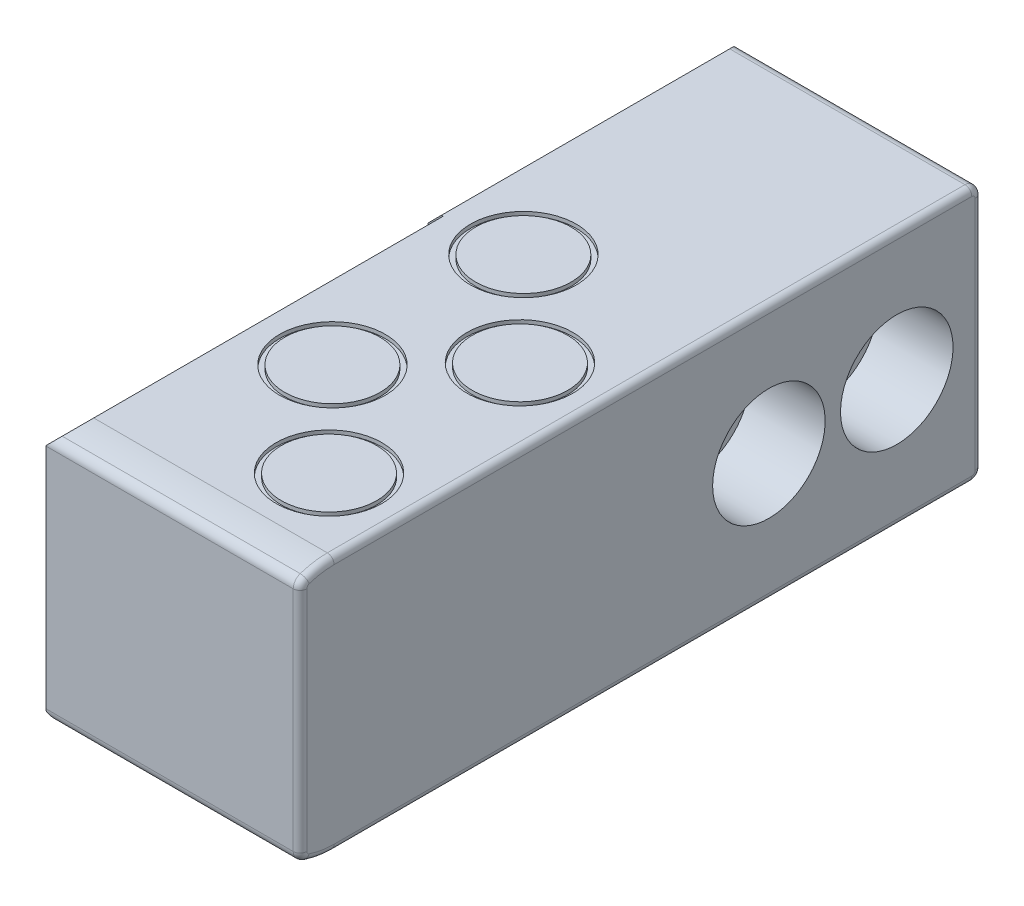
ISO-10303-21;
HEADER;
FILE_DESCRIPTION(('STEP AP214'),'2;1');
FILE_NAME('part.step','',(''),(''),'','','');
FILE_SCHEMA(('AUTOMOTIVE_DESIGN { 1 0 10303 214 1 1 1 1 }'));
ENDSEC;
DATA;
#1=APPLICATION_CONTEXT('core data for automotive mechanical design processes');
#2=APPLICATION_PROTOCOL_DEFINITION('international standard','automotive_design',2000,#1);
#3=PRODUCT_CONTEXT('',#1,'mechanical');
#4=PRODUCT('Part','Part','',(#3));
#5=PRODUCT_RELATED_PRODUCT_CATEGORY('part','',(#4));
#6=PRODUCT_DEFINITION_FORMATION('','',#4);
#7=PRODUCT_DEFINITION_CONTEXT('part definition',#1,'design');
#8=PRODUCT_DEFINITION('design','',#6,#7);
#9=PRODUCT_DEFINITION_SHAPE('','',#8);
#10=(LENGTH_UNIT() NAMED_UNIT(*) SI_UNIT(.MILLI.,.METRE.));
#11=(NAMED_UNIT(*) PLANE_ANGLE_UNIT() SI_UNIT($,.RADIAN.));
#12=(NAMED_UNIT(*) SI_UNIT($,.STERADIAN.) SOLID_ANGLE_UNIT());
#13=UNCERTAINTY_MEASURE_WITH_UNIT(LENGTH_MEASURE(1.E-05),#10,'distance_accuracy_value','');
#14=(GEOMETRIC_REPRESENTATION_CONTEXT(3) GLOBAL_UNCERTAINTY_ASSIGNED_CONTEXT((#13)) GLOBAL_UNIT_ASSIGNED_CONTEXT((#10,
#11,#12)) REPRESENTATION_CONTEXT('',''));
#15=CARTESIAN_POINT('',(0.,0.,0.));
#16=DIRECTION('',(0.,0.,1.));
#17=DIRECTION('',(1.,0.,0.));
#18=AXIS2_PLACEMENT_3D('',#15,#16,#17);
#19=CARTESIAN_POINT('',(0.,-8.47259001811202,27.813));
#20=DIRECTION('',(1.,0.,0.));
#21=DIRECTION('',(0.,0.,-1.));
#22=AXIS2_PLACEMENT_3D('',#19,#20,#21);
#23=PLANE('',#22);
#24=CARTESIAN_POINT('',(0.,0.,-15.875));
#25=DIRECTION('',(-1.,0.,0.));
#26=DIRECTION('',(0.,0.,1.));
#27=AXIS2_PLACEMENT_3D('',#24,#25,#26);
#28=CIRCLE('',#27,4.191);
#29=CARTESIAN_POINT('',(0.,0.,-11.684));
#30=VERTEX_POINT('',#29);
#31=EDGE_CURVE('E313',#30,#30,#28,.T.);
#32=ORIENTED_EDGE('',*,*,#31,.T.);
#33=EDGE_LOOP('',(#32));
#34=FACE_BOUND('',#33,.T.);
#35=CARTESIAN_POINT('',(0.,8.47259001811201,27.813));
#36=DIRECTION('',(1.,0.,0.));
#37=DIRECTION('',(0.,0.,-1.));
#38=AXIS2_PLACEMENT_3D('',#35,#36,#37);
#39=CIRCLE('',#38,0.254000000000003);
#40=CARTESIAN_POINT('',(0.,8.71338956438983,27.8938181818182));
#41=VERTEX_POINT('',#40);
#42=CARTESIAN_POINT('',(0.,8.47259001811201,28.067));
#43=VERTEX_POINT('',#42);
#44=EDGE_CURVE('E243',#41,#43,#39,.T.);
#45=ORIENTED_EDGE('',*,*,#44,.T.);
#46=DIRECTION('',(0.,-1.,0.));
#47=VECTOR('',#46,1.);
#48=CARTESIAN_POINT('',(0.,-8.47259001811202,28.067));
#49=LINE('',#48,#47);
#50=CARTESIAN_POINT('',(0.,-8.47259001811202,28.067));
#51=VERTEX_POINT('',#50);
#52=EDGE_CURVE('E245',#43,#51,#49,.T.);
#53=ORIENTED_EDGE('',*,*,#52,.T.);
#54=CARTESIAN_POINT('',(0.,-8.47259001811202,27.813));
#55=DIRECTION('',(1.,0.,0.));
#56=DIRECTION('',(0.,0.,-1.));
#57=AXIS2_PLACEMENT_3D('',#54,#55,#56);
#58=CIRCLE('',#57,0.254000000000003);
#59=CARTESIAN_POINT('',(0.,-8.71338956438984,27.8938181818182));
#60=VERTEX_POINT('',#59);
#61=EDGE_CURVE('E205',#51,#60,#58,.T.);
#62=ORIENTED_EDGE('',*,*,#61,.T.);
#63=CARTESIAN_POINT('',(0.,-3.17500000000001,26.035));
#64=DIRECTION('',(1.,0.,0.));
#65=DIRECTION('',(0.,0.,-1.));
#66=AXIS2_PLACEMENT_3D('',#63,#64,#65);
#67=CIRCLE('',#66,5.842);
#68=CARTESIAN_POINT('',(0.,-9.01700000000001,26.035));
#69=VERTEX_POINT('',#68);
#70=EDGE_CURVE('E207',#60,#69,#67,.T.);
#71=ORIENTED_EDGE('',*,*,#70,.T.);
#72=DIRECTION('',(0.,0.,-1.));
#73=VECTOR('',#72,1.);
#74=CARTESIAN_POINT('',(0.,-9.01700000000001,27.813));
#75=LINE('',#74,#73);
#76=CARTESIAN_POINT('',(0.,-9.017,-21.463));
#77=VERTEX_POINT('',#76);
#78=EDGE_CURVE('E231',#69,#77,#75,.T.);
#79=ORIENTED_EDGE('',*,*,#78,.T.);
#80=CARTESIAN_POINT('',(0.,-8.76300000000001,-21.463));
#81=DIRECTION('',(1.,0.,0.));
#82=DIRECTION('',(0.,0.,-1.));
#83=AXIS2_PLACEMENT_3D('',#80,#81,#82);
#84=CIRCLE('',#83,0.253999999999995);
#85=CARTESIAN_POINT('',(0.,-8.76300000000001,-21.717));
#86=VERTEX_POINT('',#85);
#87=EDGE_CURVE('E233',#77,#86,#84,.T.);
#88=ORIENTED_EDGE('',*,*,#87,.T.);
#89=DIRECTION('',(0.,1.,0.));
#90=VECTOR('',#89,1.);
#91=CARTESIAN_POINT('',(0.,-8.472590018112,-21.717));
#92=LINE('',#91,#90);
#93=CARTESIAN_POINT('',(0.,8.76300000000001,-21.717));
#94=VERTEX_POINT('',#93);
#95=EDGE_CURVE('E235',#86,#94,#92,.T.);
#96=ORIENTED_EDGE('',*,*,#95,.T.);
#97=CARTESIAN_POINT('',(0.,8.76300000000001,-21.463));
#98=DIRECTION('',(1.,0.,0.));
#99=DIRECTION('',(0.,0.,-1.));
#100=AXIS2_PLACEMENT_3D('',#97,#98,#99);
#101=CIRCLE('',#100,0.253999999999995);
#102=CARTESIAN_POINT('',(0.,9.01700000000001,-21.463));
#103=VERTEX_POINT('',#102);
#104=EDGE_CURVE('E237',#94,#103,#101,.T.);
#105=ORIENTED_EDGE('',*,*,#104,.T.);
#106=DIRECTION('',(0.,0.,1.));
#107=VECTOR('',#106,1.);
#108=CARTESIAN_POINT('',(0.,9.017,27.813));
#109=LINE('',#108,#107);
#110=CARTESIAN_POINT('',(0.,9.017,26.035));
#111=VERTEX_POINT('',#110);
#112=EDGE_CURVE('E239',#103,#111,#109,.T.);
#113=ORIENTED_EDGE('',*,*,#112,.T.);
#114=CARTESIAN_POINT('',(0.,3.175,26.035));
#115=DIRECTION('',(1.,0.,0.));
#116=DIRECTION('',(0.,0.,-1.));
#117=AXIS2_PLACEMENT_3D('',#114,#115,#116);
#118=CIRCLE('',#117,5.842);
#119=EDGE_CURVE('E241',#111,#41,#118,.T.);
#120=ORIENTED_EDGE('',*,*,#119,.T.);
#121=EDGE_LOOP('',(#45,#53,#62,#71,#79,#88,#96,#105,#113,#120));
#122=FACE_BOUND('',#121,.T.);
#123=CARTESIAN_POINT('',(0.,0.,-6.35));
#124=DIRECTION('',(-1.,0.,0.));
#125=DIRECTION('',(0.,0.,1.));
#126=AXIS2_PLACEMENT_3D('',#123,#124,#125);
#127=CIRCLE('',#126,4.191);
#128=CARTESIAN_POINT('',(0.,0.,-2.159));
#129=VERTEX_POINT('',#128);
#130=EDGE_CURVE('E370',#129,#129,#127,.T.);
#131=ORIENTED_EDGE('',*,*,#130,.T.);
#132=EDGE_LOOP('',(#131));
#133=FACE_BOUND('',#132,.T.);
#134=ADVANCED_FACE('F37',(#34,#122,#133),#23,.T.);
#135=CARTESIAN_POINT('',(-19.05,0.,-6.35));
#136=DIRECTION('',(1.,0.,0.));
#137=DIRECTION('',(0.,0.,-1.));
#138=AXIS2_PLACEMENT_3D('',#135,#136,#137);
#139=CYLINDRICAL_SURFACE('',#138,2.794);
#140=CARTESIAN_POINT('',(-19.05,0.,-6.35));
#141=DIRECTION('',(1.,0.,0.));
#142=DIRECTION('',(0.,0.,-1.));
#143=AXIS2_PLACEMENT_3D('',#140,#141,#142);
#144=CIRCLE('',#143,2.794);
#145=CARTESIAN_POINT('',(-19.05,0.,-9.144));
#146=VERTEX_POINT('',#145);
#147=EDGE_CURVE('E472',#146,#146,#144,.T.);
#148=CARTESIAN_POINT('',(-5.588,0.,-6.35));
#149=DIRECTION('',(1.,0.,0.));
#150=DIRECTION('',(0.,0.,-1.));
#151=AXIS2_PLACEMENT_3D('',#148,#149,#150);
#152=CIRCLE('',#151,2.794);
#153=CARTESIAN_POINT('',(-5.588,0.,-9.144));
#154=VERTEX_POINT('',#153);
#155=EDGE_CURVE('E310',#154,#154,#152,.F.);
#156=CARTESIAN_POINT('',(-19.05,0.,-9.144));
#157=CARTESIAN_POINT('',(-18.9097708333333,0.,-9.144));
#158=CARTESIAN_POINT('',(-18.7695416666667,0.,-9.144));
#159=CARTESIAN_POINT('',(-18.4890833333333,0.,-9.144));
#160=CARTESIAN_POINT('',(-18.3488541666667,0.,-9.144));
#161=CARTESIAN_POINT('',(-18.0683958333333,0.,-9.144));
#162=CARTESIAN_POINT('',(-17.9281666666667,0.,-9.144));
#163=CARTESIAN_POINT('',(-17.6477083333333,0.,-9.144));
#164=CARTESIAN_POINT('',(-17.5074791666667,0.,-9.144));
#165=CARTESIAN_POINT('',(-17.2270208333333,0.,-9.144));
#166=CARTESIAN_POINT('',(-17.0867916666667,0.,-9.144));
#167=CARTESIAN_POINT('',(-16.8063333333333,0.,-9.144));
#168=CARTESIAN_POINT('',(-16.6661041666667,0.,-9.144));
#169=CARTESIAN_POINT('',(-16.3856458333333,0.,-9.144));
#170=CARTESIAN_POINT('',(-16.2454166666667,0.,-9.144));
#171=CARTESIAN_POINT('',(-15.9649583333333,0.,-9.144));
#172=CARTESIAN_POINT('',(-15.8247291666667,0.,-9.144));
#173=CARTESIAN_POINT('',(-15.5442708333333,0.,-9.144));
#174=CARTESIAN_POINT('',(-15.4040416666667,0.,-9.144));
#175=CARTESIAN_POINT('',(-15.1235833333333,0.,-9.144));
#176=CARTESIAN_POINT('',(-14.9833541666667,0.,-9.144));
#177=CARTESIAN_POINT('',(-14.7028958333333,0.,-9.144));
#178=CARTESIAN_POINT('',(-14.5626666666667,0.,-9.144));
#179=CARTESIAN_POINT('',(-14.2822083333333,0.,-9.144));
#180=CARTESIAN_POINT('',(-14.1419791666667,0.,-9.144));
#181=CARTESIAN_POINT('',(-13.8615208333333,0.,-9.144));
#182=CARTESIAN_POINT('',(-13.7212916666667,0.,-9.144));
#183=CARTESIAN_POINT('',(-13.4408333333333,0.,-9.144));
#184=CARTESIAN_POINT('',(-13.3006041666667,0.,-9.144));
#185=CARTESIAN_POINT('',(-13.0201458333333,0.,-9.144));
#186=CARTESIAN_POINT('',(-12.8799166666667,0.,-9.144));
#187=CARTESIAN_POINT('',(-12.5994583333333,0.,-9.144));
#188=CARTESIAN_POINT('',(-12.4592291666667,0.,-9.144));
#189=CARTESIAN_POINT('',(-12.1787708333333,0.,-9.144));
#190=CARTESIAN_POINT('',(-12.0385416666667,0.,-9.144));
#191=CARTESIAN_POINT('',(-11.7580833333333,0.,-9.144));
#192=CARTESIAN_POINT('',(-11.6178541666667,0.,-9.144));
#193=CARTESIAN_POINT('',(-11.3373958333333,0.,-9.144));
#194=CARTESIAN_POINT('',(-11.1971666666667,0.,-9.144));
#195=CARTESIAN_POINT('',(-10.9167083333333,0.,-9.144));
#196=CARTESIAN_POINT('',(-10.7764791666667,0.,-9.144));
#197=CARTESIAN_POINT('',(-10.4960208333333,0.,-9.144));
#198=CARTESIAN_POINT('',(-10.3557916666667,0.,-9.144));
#199=CARTESIAN_POINT('',(-10.0753333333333,0.,-9.144));
#200=CARTESIAN_POINT('',(-9.93510416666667,0.,-9.144));
#201=CARTESIAN_POINT('',(-9.65464583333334,0.,-9.144));
#202=CARTESIAN_POINT('',(-9.51441666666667,0.,-9.144));
#203=CARTESIAN_POINT('',(-9.23395833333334,0.,-9.144));
#204=CARTESIAN_POINT('',(-9.09372916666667,0.,-9.144));
#205=CARTESIAN_POINT('',(-8.81327083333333,0.,-9.144));
#206=CARTESIAN_POINT('',(-8.67304166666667,0.,-9.144));
#207=CARTESIAN_POINT('',(-8.39258333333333,0.,-9.144));
#208=CARTESIAN_POINT('',(-8.25235416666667,0.,-9.144));
#209=CARTESIAN_POINT('',(-7.97189583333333,0.,-9.144));
#210=CARTESIAN_POINT('',(-7.83166666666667,0.,-9.144));
#211=CARTESIAN_POINT('',(-7.55120833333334,0.,-9.144));
#212=CARTESIAN_POINT('',(-7.41097916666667,0.,-9.144));
#213=CARTESIAN_POINT('',(-7.13052083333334,0.,-9.144));
#214=CARTESIAN_POINT('',(-6.99029166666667,0.,-9.144));
#215=CARTESIAN_POINT('',(-6.70983333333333,0.,-9.144));
#216=CARTESIAN_POINT('',(-6.56960416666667,0.,-9.144));
#217=CARTESIAN_POINT('',(-6.28914583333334,0.,-9.144));
#218=CARTESIAN_POINT('',(-6.14891666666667,0.,-9.144));
#219=CARTESIAN_POINT('',(-5.86845833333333,0.,-9.144));
#220=CARTESIAN_POINT('',(-5.72822916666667,0.,-9.144));
#221=CARTESIAN_POINT('',(-5.588,0.,-9.144));
#222=B_SPLINE_CURVE_WITH_KNOTS('',3,(#156,#157,#158,#159,#160,#161,#162,#163,#164,#165,#166,
#167,#168,#169,#170,#171,#172,#173,#174,#175,#176,#177,#178,#179,#180,#181,#182,#183,#184,#185,
#186,#187,#188,#189,#190,#191,#192,#193,#194,#195,#196,#197,#198,#199,#200,#201,#202,#203,#204,
#205,#206,#207,#208,#209,#210,#211,#212,#213,#214,#215,#216,#217,#218,#219,#220,#221),
.UNSPECIFIED.,.F.,.F.,(4,2,2,2,2,2,2,2,2,2,2,2,2,2,2,2,2,2,2,2,2,2,2,2,2,2,2,2,2,2,2,2,4),(0.,
0.420687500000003,0.841375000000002,1.2620625,1.68275,2.1034375,2.524125,2.9448125,3.3655,
3.7861875,4.206875,4.6275625,5.04825,5.4689375,5.889625,6.3103125,6.731,7.1516875,7.572375,
7.9930625,8.41375,8.8344375,9.255125,9.6758125,10.0965,10.5171875,10.937875,11.3585625,11.77925,
12.1999375,12.620625,13.0413125,13.462),.UNSPECIFIED.);
#223=EDGE_CURVE('BSEAM487',#146,#154,#222,.T.);
#224=ORIENTED_EDGE('',*,*,#147,.F.);
#225=ORIENTED_EDGE('',*,*,#155,.F.);
#226=ORIENTED_EDGE('',*,*,#223,.T.);
#227=ORIENTED_EDGE('',*,*,#223,.F.);
#228=EDGE_LOOP('',(#224,#226,#225,#227));
#229=FACE_BOUND('',#228,.T.);
#230=ADVANCED_FACE('F487',(#229),#139,.F.);
#231=CARTESIAN_POINT('',(-19.05,0.,-15.875));
#232=DIRECTION('',(1.,0.,0.));
#233=DIRECTION('',(0.,0.,-1.));
#234=AXIS2_PLACEMENT_3D('',#231,#232,#233);
#235=CYLINDRICAL_SURFACE('',#234,2.794);
#236=CARTESIAN_POINT('',(-19.05,0.,-15.875));
#237=DIRECTION('',(1.,0.,0.));
#238=DIRECTION('',(0.,0.,-1.));
#239=AXIS2_PLACEMENT_3D('',#236,#237,#238);
#240=CIRCLE('',#239,2.794);
#241=CARTESIAN_POINT('',(-19.05,0.,-18.669));
#242=VERTEX_POINT('',#241);
#243=EDGE_CURVE('E212',#242,#242,#240,.T.);
#244=CARTESIAN_POINT('',(-5.588,0.,-15.875));
#245=DIRECTION('',(1.,0.,0.));
#246=DIRECTION('',(0.,0.,-1.));
#247=AXIS2_PLACEMENT_3D('',#244,#245,#246);
#248=CIRCLE('',#247,2.794);
#249=CARTESIAN_POINT('',(-5.588,0.,-18.669));
#250=VERTEX_POINT('',#249);
#251=EDGE_CURVE('E279',#250,#250,#248,.F.);
#252=CARTESIAN_POINT('',(-19.05,0.,-18.669));
#253=CARTESIAN_POINT('',(-18.9097708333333,0.,-18.669));
#254=CARTESIAN_POINT('',(-18.7695416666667,0.,-18.669));
#255=CARTESIAN_POINT('',(-18.4890833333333,0.,-18.669));
#256=CARTESIAN_POINT('',(-18.3488541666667,0.,-18.669));
#257=CARTESIAN_POINT('',(-18.0683958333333,0.,-18.669));
#258=CARTESIAN_POINT('',(-17.9281666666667,0.,-18.669));
#259=CARTESIAN_POINT('',(-17.6477083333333,0.,-18.669));
#260=CARTESIAN_POINT('',(-17.5074791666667,0.,-18.669));
#261=CARTESIAN_POINT('',(-17.2270208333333,0.,-18.669));
#262=CARTESIAN_POINT('',(-17.0867916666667,0.,-18.669));
#263=CARTESIAN_POINT('',(-16.8063333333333,0.,-18.669));
#264=CARTESIAN_POINT('',(-16.6661041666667,0.,-18.669));
#265=CARTESIAN_POINT('',(-16.3856458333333,0.,-18.669));
#266=CARTESIAN_POINT('',(-16.2454166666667,0.,-18.669));
#267=CARTESIAN_POINT('',(-15.9649583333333,0.,-18.669));
#268=CARTESIAN_POINT('',(-15.8247291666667,0.,-18.669));
#269=CARTESIAN_POINT('',(-15.5442708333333,0.,-18.669));
#270=CARTESIAN_POINT('',(-15.4040416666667,0.,-18.669));
#271=CARTESIAN_POINT('',(-15.1235833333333,0.,-18.669));
#272=CARTESIAN_POINT('',(-14.9833541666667,0.,-18.669));
#273=CARTESIAN_POINT('',(-14.7028958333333,0.,-18.669));
#274=CARTESIAN_POINT('',(-14.5626666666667,0.,-18.669));
#275=CARTESIAN_POINT('',(-14.2822083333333,0.,-18.669));
#276=CARTESIAN_POINT('',(-14.1419791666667,0.,-18.669));
#277=CARTESIAN_POINT('',(-13.8615208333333,0.,-18.669));
#278=CARTESIAN_POINT('',(-13.7212916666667,0.,-18.669));
#279=CARTESIAN_POINT('',(-13.4408333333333,0.,-18.669));
#280=CARTESIAN_POINT('',(-13.3006041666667,0.,-18.669));
#281=CARTESIAN_POINT('',(-13.0201458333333,0.,-18.669));
#282=CARTESIAN_POINT('',(-12.8799166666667,0.,-18.669));
#283=CARTESIAN_POINT('',(-12.5994583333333,0.,-18.669));
#284=CARTESIAN_POINT('',(-12.4592291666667,0.,-18.669));
#285=CARTESIAN_POINT('',(-12.1787708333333,0.,-18.669));
#286=CARTESIAN_POINT('',(-12.0385416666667,0.,-18.669));
#287=CARTESIAN_POINT('',(-11.7580833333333,0.,-18.669));
#288=CARTESIAN_POINT('',(-11.6178541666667,0.,-18.669));
#289=CARTESIAN_POINT('',(-11.3373958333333,0.,-18.669));
#290=CARTESIAN_POINT('',(-11.1971666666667,0.,-18.669));
#291=CARTESIAN_POINT('',(-10.9167083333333,0.,-18.669));
#292=CARTESIAN_POINT('',(-10.7764791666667,0.,-18.669));
#293=CARTESIAN_POINT('',(-10.4960208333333,0.,-18.669));
#294=CARTESIAN_POINT('',(-10.3557916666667,0.,-18.669));
#295=CARTESIAN_POINT('',(-10.0753333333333,0.,-18.669));
#296=CARTESIAN_POINT('',(-9.93510416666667,0.,-18.669));
#297=CARTESIAN_POINT('',(-9.65464583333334,0.,-18.669));
#298=CARTESIAN_POINT('',(-9.51441666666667,0.,-18.669));
#299=CARTESIAN_POINT('',(-9.23395833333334,0.,-18.669));
#300=CARTESIAN_POINT('',(-9.09372916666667,0.,-18.669));
#301=CARTESIAN_POINT('',(-8.81327083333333,0.,-18.669));
#302=CARTESIAN_POINT('',(-8.67304166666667,0.,-18.669));
#303=CARTESIAN_POINT('',(-8.39258333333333,0.,-18.669));
#304=CARTESIAN_POINT('',(-8.25235416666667,0.,-18.669));
#305=CARTESIAN_POINT('',(-7.97189583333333,0.,-18.669));
#306=CARTESIAN_POINT('',(-7.83166666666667,0.,-18.669));
#307=CARTESIAN_POINT('',(-7.55120833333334,0.,-18.669));
#308=CARTESIAN_POINT('',(-7.41097916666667,0.,-18.669));
#309=CARTESIAN_POINT('',(-7.13052083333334,0.,-18.669));
#310=CARTESIAN_POINT('',(-6.99029166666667,0.,-18.669));
#311=CARTESIAN_POINT('',(-6.70983333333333,0.,-18.669));
#312=CARTESIAN_POINT('',(-6.56960416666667,0.,-18.669));
#313=CARTESIAN_POINT('',(-6.28914583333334,0.,-18.669));
#314=CARTESIAN_POINT('',(-6.14891666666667,0.,-18.669));
#315=CARTESIAN_POINT('',(-5.86845833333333,0.,-18.669));
#316=CARTESIAN_POINT('',(-5.72822916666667,0.,-18.669));
#317=CARTESIAN_POINT('',(-5.588,0.,-18.669));
#318=B_SPLINE_CURVE_WITH_KNOTS('',3,(#252,#253,#254,#255,#256,#257,#258,#259,#260,#261,#262,
#263,#264,#265,#266,#267,#268,#269,#270,#271,#272,#273,#274,#275,#276,#277,#278,#279,#280,#281,
#282,#283,#284,#285,#286,#287,#288,#289,#290,#291,#292,#293,#294,#295,#296,#297,#298,#299,#300,
#301,#302,#303,#304,#305,#306,#307,#308,#309,#310,#311,#312,#313,#314,#315,#316,#317),
.UNSPECIFIED.,.F.,.F.,(4,2,2,2,2,2,2,2,2,2,2,2,2,2,2,2,2,2,2,2,2,2,2,2,2,2,2,2,2,2,2,2,4),(0.,
0.420687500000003,0.841375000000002,1.2620625,1.68275,2.1034375,2.524125,2.9448125,3.3655,
3.7861875,4.206875,4.6275625,5.04825,5.4689375,5.889625,6.3103125,6.731,7.1516875,7.572375,
7.9930625,8.41375,8.8344375,9.255125,9.6758125,10.0965,10.5171875,10.937875,11.3585625,11.77925,
12.1999375,12.620625,13.0413125,13.462),.UNSPECIFIED.);
#319=EDGE_CURVE('BSEAM483',#242,#250,#318,.T.);
#320=ORIENTED_EDGE('',*,*,#243,.F.);
#321=ORIENTED_EDGE('',*,*,#251,.F.);
#322=ORIENTED_EDGE('',*,*,#319,.T.);
#323=ORIENTED_EDGE('',*,*,#319,.F.);
#324=EDGE_LOOP('',(#320,#322,#321,#323));
#325=FACE_BOUND('',#324,.T.);
#326=ADVANCED_FACE('F483',(#325),#235,.F.);
#327=CARTESIAN_POINT('',(-19.05,-9.52500000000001,26.035));
#328=DIRECTION('',(0.,-1.,0.));
#329=DIRECTION('',(0.,0.,-1.));
#330=AXIS2_PLACEMENT_3D('',#327,#328,#329);
#331=PLANE('',#330);
#332=DIRECTION('',(1.,0.,0.));
#333=VECTOR('',#332,1.);
#334=CARTESIAN_POINT('',(-19.05,-9.52500000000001,26.035));
#335=LINE('',#334,#333);
#336=CARTESIAN_POINT('',(-18.034,-9.52500000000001,26.035));
#337=VERTEX_POINT('',#336);
#338=CARTESIAN_POINT('',(-0.508000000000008,-9.52500000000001,26.035));
#339=VERTEX_POINT('',#338);
#340=EDGE_CURVE('E226',#337,#339,#335,.T.);
#341=ORIENTED_EDGE('',*,*,#340,.F.);
#342=DIRECTION('',(0.,0.,-1.));
#343=VECTOR('',#342,1.);
#344=CARTESIAN_POINT('',(-18.034,-9.525,-21.463));
#345=LINE('',#344,#343);
#346=CARTESIAN_POINT('',(-18.034,-9.525,-21.463));
#347=VERTEX_POINT('',#346);
#348=EDGE_CURVE('E329',#337,#347,#345,.T.);
#349=ORIENTED_EDGE('',*,*,#348,.T.);
#350=DIRECTION('',(1.,0.,0.));
#351=VECTOR('',#350,1.);
#352=CARTESIAN_POINT('',(-19.05,-9.525,-21.463));
#353=LINE('',#352,#351);
#354=CARTESIAN_POINT('',(-0.508000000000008,-9.525,-21.463));
#355=VERTEX_POINT('',#354);
#356=EDGE_CURVE('E224',#347,#355,#353,.T.);
#357=ORIENTED_EDGE('',*,*,#356,.T.);
#358=DIRECTION('',(0.,0.,-1.));
#359=VECTOR('',#358,1.);
#360=CARTESIAN_POINT('',(-0.508000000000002,-9.52500000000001,26.035));
#361=LINE('',#360,#359);
#362=EDGE_CURVE('E268',#355,#339,#361,.F.);
#363=ORIENTED_EDGE('',*,*,#362,.T.);
#364=EDGE_LOOP('',(#341,#349,#357,#363));
#365=FACE_BOUND('',#364,.T.);
#366=CARTESIAN_POINT('',(-12.446,-9.525,13.716));
#367=DIRECTION('',(0.,1.,0.));
#368=DIRECTION('',(0.,0.,1.));
#369=AXIS2_PLACEMENT_3D('',#366,#367,#368);
#370=CIRCLE('',#369,3.93700000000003);
#371=CARTESIAN_POINT('',(-12.446,-9.525,17.653));
#372=VERTEX_POINT('',#371);
#373=EDGE_CURVE('E418',#372,#372,#370,.T.);
#374=ORIENTED_EDGE('',*,*,#373,.T.);
#375=EDGE_LOOP('',(#374));
#376=FACE_BOUND('',#375,.T.);
#377=CARTESIAN_POINT('',(-5.588,-9.525,20.828));
#378=DIRECTION('',(0.,1.,0.));
#379=DIRECTION('',(0.,0.,-1.));
#380=AXIS2_PLACEMENT_3D('',#377,#378,#379);
#381=CIRCLE('',#380,3.93700000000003);
#382=CARTESIAN_POINT('',(-5.588,-9.525,16.891));
#383=VERTEX_POINT('',#382);
#384=EDGE_CURVE('E406',#383,#383,#381,.T.);
#385=ORIENTED_EDGE('',*,*,#384,.T.);
#386=EDGE_LOOP('',(#385));
#387=FACE_BOUND('',#386,.T.);
#388=CARTESIAN_POINT('',(-12.446,-9.525,-0.508000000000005));
#389=DIRECTION('',(0.,1.,0.));
#390=DIRECTION('',(0.,0.,1.));
#391=AXIS2_PLACEMENT_3D('',#388,#389,#390);
#392=CIRCLE('',#391,3.93700000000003);
#393=CARTESIAN_POINT('',(-12.446,-9.525,3.42900000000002));
#394=VERTEX_POINT('',#393);
#395=EDGE_CURVE('E394',#394,#394,#392,.T.);
#396=ORIENTED_EDGE('',*,*,#395,.T.);
#397=EDGE_LOOP('',(#396));
#398=FACE_BOUND('',#397,.T.);
#399=CARTESIAN_POINT('',(-5.588,-9.525,6.604));
#400=DIRECTION('',(0.,1.,0.));
#401=DIRECTION('',(0.,0.,-1.));
#402=AXIS2_PLACEMENT_3D('',#399,#400,#401);
#403=CIRCLE('',#402,3.93700000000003);
#404=CARTESIAN_POINT('',(-5.588,-9.525,2.66699999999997));
#405=VERTEX_POINT('',#404);
#406=EDGE_CURVE('E382',#405,#405,#403,.T.);
#407=ORIENTED_EDGE('',*,*,#406,.T.);
#408=EDGE_LOOP('',(#407));
#409=FACE_BOUND('',#408,.T.);
#410=ADVANCED_FACE('F486',(#365,#376,#387,#398,#409),#331,.T.);
#411=CARTESIAN_POINT('',(-19.05,-8.47259001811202,27.813));
#412=DIRECTION('',(1.,0.,0.));
#413=DIRECTION('',(0.,0.,-1.));
#414=AXIS2_PLACEMENT_3D('',#411,#412,#413);
#415=CYLINDRICAL_SURFACE('',#414,0.762000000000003);
#416=CARTESIAN_POINT('',(-18.923,-8.47259001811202,27.813));
#417=DIRECTION('',(1.,0.,0.));
#418=DIRECTION('',(0.,0.,-1.));
#419=AXIS2_PLACEMENT_3D('',#416,#417,#418);
#420=CIRCLE('',#419,0.762000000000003);
#421=CARTESIAN_POINT('',(-18.923,-8.63600000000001,28.5572722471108));
#422=VERTEX_POINT('',#421);
#423=CARTESIAN_POINT('',(-18.923,-8.47259001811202,28.575));
#424=VERTEX_POINT('',#423);
#425=EDGE_CURVE('E178',#422,#424,#420,.F.);
#426=ORIENTED_EDGE('',*,*,#425,.F.);
#427=CARTESIAN_POINT('',(-19.086409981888,-8.47259001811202,27.813));
#428=DIRECTION('',(-0.70710678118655,-0.707106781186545,0.));
#429=DIRECTION('',(0.707106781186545,-0.70710678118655,0.));
#430=AXIS2_PLACEMENT_3D('',#427,#428,#429);
#431=ELLIPSE('',#430,1.0776307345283,0.762000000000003);
#432=CARTESIAN_POINT('',(-18.3640113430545,-9.19498865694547,28.0554545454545));
#433=VERTEX_POINT('',#432);
#434=EDGE_CURVE('E347',#422,#433,#431,.F.);
#435=ORIENTED_EDGE('',*,*,#434,.T.);
#436=DIRECTION('',(1.,0.,0.));
#437=VECTOR('',#436,1.);
#438=CARTESIAN_POINT('',(-19.05,-9.19498865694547,28.0554545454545));
#439=LINE('',#438,#437);
#440=CARTESIAN_POINT('',(-0.507999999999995,-9.19498865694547,28.0554545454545));
#441=VERTEX_POINT('',#440);
#442=EDGE_CURVE('E228',#433,#441,#439,.T.);
#443=ORIENTED_EDGE('',*,*,#442,.T.);
#444=CARTESIAN_POINT('',(-0.507999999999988,-8.47259001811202,27.813));
#445=DIRECTION('',(1.,0.,0.));
#446=DIRECTION('',(0.,0.,-1.));
#447=AXIS2_PLACEMENT_3D('',#444,#445,#446);
#448=CIRCLE('',#447,0.762000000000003);
#449=CARTESIAN_POINT('',(-0.507999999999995,-8.47259001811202,28.575));
#450=VERTEX_POINT('',#449);
#451=EDGE_CURVE('E203',#441,#450,#448,.F.);
#452=ORIENTED_EDGE('',*,*,#451,.T.);
#453=DIRECTION('',(1.,0.,0.));
#454=VECTOR('',#453,1.);
#455=CARTESIAN_POINT('',(-19.05,-8.47259001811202,28.575));
#456=LINE('',#455,#454);
#457=EDGE_CURVE('E196',#424,#450,#456,.T.);
#458=ORIENTED_EDGE('',*,*,#457,.F.);
#459=EDGE_LOOP('',(#426,#435,#443,#452,#458));
#460=FACE_BOUND('',#459,.T.);
#461=ADVANCED_FACE('F201',(#460),#415,.T.);
#462=CARTESIAN_POINT('',(-19.05,-8.47259001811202,28.575));
#463=DIRECTION('',(0.,0.,1.));
#464=DIRECTION('',(0.,-1.,0.));
#465=AXIS2_PLACEMENT_3D('',#462,#463,#464);
#466=PLANE('',#465);
#467=DIRECTION('',(0.,1.,0.));
#468=VECTOR('',#467,1.);
#469=CARTESIAN_POINT('',(-18.923,-8.47259001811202,28.575));
#470=LINE('',#469,#468);
#471=CARTESIAN_POINT('',(-18.923,8.472590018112,28.575));
#472=VERTEX_POINT('',#471);
#473=EDGE_CURVE('E183',#424,#472,#470,.T.);
#474=ORIENTED_EDGE('',*,*,#473,.F.);
#475=ORIENTED_EDGE('',*,*,#457,.T.);
#476=DIRECTION('',(0.,-1.,0.));
#477=VECTOR('',#476,1.);
#478=CARTESIAN_POINT('',(-0.508000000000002,-8.47259001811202,28.575));
#479=LINE('',#478,#477);
#480=CARTESIAN_POINT('',(-0.507999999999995,8.47259001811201,28.575));
#481=VERTEX_POINT('',#480);
#482=EDGE_CURVE('E248',#450,#481,#479,.F.);
#483=ORIENTED_EDGE('',*,*,#482,.T.);
#484=DIRECTION('',(1.,0.,0.));
#485=VECTOR('',#484,1.);
#486=CARTESIAN_POINT('',(-19.05,8.47259001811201,28.575));
#487=LINE('',#486,#485);
#488=EDGE_CURVE('E198',#472,#481,#487,.T.);
#489=ORIENTED_EDGE('',*,*,#488,.F.);
#490=EDGE_LOOP('',(#474,#475,#483,#489));
#491=FACE_BOUND('',#490,.T.);
#492=ADVANCED_FACE('F194',(#491),#466,.T.);
#493=CARTESIAN_POINT('',(-19.05,8.47259001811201,27.813));
#494=DIRECTION('',(1.,0.,0.));
#495=DIRECTION('',(0.,0.,-1.));
#496=AXIS2_PLACEMENT_3D('',#493,#494,#495);
#497=CYLINDRICAL_SURFACE('',#496,0.762000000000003);
#498=DIRECTION('',(1.,0.,0.));
#499=VECTOR('',#498,1.);
#500=CARTESIAN_POINT('',(-19.05,9.19498865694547,28.0554545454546));
#501=LINE('',#500,#499);
#502=CARTESIAN_POINT('',(-18.2370113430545,9.19498865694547,28.0554545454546));
#503=VERTEX_POINT('',#502);
#504=CARTESIAN_POINT('',(-0.508000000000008,9.19498865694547,28.0554545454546));
#505=VERTEX_POINT('',#504);
#506=EDGE_CURVE('E209',#503,#505,#501,.T.);
#507=ORIENTED_EDGE('',*,*,#506,.F.);
#508=CARTESIAN_POINT('',(-18.959409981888,8.47259001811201,27.813));
#509=DIRECTION('',(-0.707106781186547,0.707106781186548,0.));
#510=DIRECTION('',(0.707106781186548,0.707106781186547,0.));
#511=AXIS2_PLACEMENT_3D('',#508,#509,#510);
#512=ELLIPSE('',#511,1.0776307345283,0.762000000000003);
#513=CARTESIAN_POINT('',(-18.923,8.509,28.5741296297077));
#514=VERTEX_POINT('',#513);
#515=EDGE_CURVE('E324',#503,#514,#512,.F.);
#516=ORIENTED_EDGE('',*,*,#515,.T.);
#517=CARTESIAN_POINT('',(-18.923,8.47259001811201,27.813));
#518=DIRECTION('',(1.,0.,0.));
#519=DIRECTION('',(0.,0.,-1.));
#520=AXIS2_PLACEMENT_3D('',#517,#518,#519);
#521=CIRCLE('',#520,0.762000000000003);
#522=EDGE_CURVE('E199',#472,#514,#521,.F.);
#523=ORIENTED_EDGE('',*,*,#522,.F.);
#524=ORIENTED_EDGE('',*,*,#488,.T.);
#525=CARTESIAN_POINT('',(-0.507999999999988,8.47259001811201,27.813));
#526=DIRECTION('',(1.,0.,0.));
#527=DIRECTION('',(0.,0.,-1.));
#528=AXIS2_PLACEMENT_3D('',#525,#526,#527);
#529=CIRCLE('',#528,0.762000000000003);
#530=EDGE_CURVE('E250',#481,#505,#529,.F.);
#531=ORIENTED_EDGE('',*,*,#530,.T.);
#532=EDGE_LOOP('',(#507,#516,#523,#524,#531));
#533=FACE_BOUND('',#532,.T.);
#534=ADVANCED_FACE('F522',(#533),#497,.T.);
#535=CARTESIAN_POINT('',(-19.05,3.175,26.035));
#536=DIRECTION('',(1.,0.,0.));
#537=DIRECTION('',(0.,0.,-1.));
#538=AXIS2_PLACEMENT_3D('',#535,#536,#537);
#539=CYLINDRICAL_SURFACE('',#538,6.35);
#540=DIRECTION('',(1.,0.,0.));
#541=VECTOR('',#540,1.);
#542=CARTESIAN_POINT('',(-19.05,9.525,26.035));
#543=LINE('',#542,#541);
#544=CARTESIAN_POINT('',(-17.907,9.525,26.035));
#545=VERTEX_POINT('',#544);
#546=CARTESIAN_POINT('',(-0.508000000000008,9.525,26.035));
#547=VERTEX_POINT('',#546);
#548=EDGE_CURVE('E216',#545,#547,#543,.T.);
#549=ORIENTED_EDGE('',*,*,#548,.F.);
#550=CARTESIAN_POINT('',(-24.257,3.175,26.035));
#551=DIRECTION('',(-0.707106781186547,0.707106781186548,0.));
#552=DIRECTION('',(0.707106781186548,0.707106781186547,0.));
#553=AXIS2_PLACEMENT_3D('',#550,#551,#552);
#554=ELLIPSE('',#553,8.98025612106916,6.35);
#555=EDGE_CURVE('E322',#545,#503,#554,.F.);
#556=ORIENTED_EDGE('',*,*,#555,.T.);
#557=ORIENTED_EDGE('',*,*,#506,.T.);
#558=CARTESIAN_POINT('',(-0.508000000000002,3.175,26.035));
#559=DIRECTION('',(1.,0.,0.));
#560=DIRECTION('',(0.,0.,-1.));
#561=AXIS2_PLACEMENT_3D('',#558,#559,#560);
#562=CIRCLE('',#561,6.35);
#563=EDGE_CURVE('E253',#505,#547,#562,.F.);
#564=ORIENTED_EDGE('',*,*,#563,.T.);
#565=EDGE_LOOP('',(#549,#556,#557,#564));
#566=FACE_BOUND('',#565,.T.);
#567=ADVANCED_FACE('F525',(#566),#539,.T.);
#568=CARTESIAN_POINT('',(-19.05,9.525,26.035));
#569=DIRECTION('',(0.,1.,0.));
#570=DIRECTION('',(0.,0.,1.));
#571=AXIS2_PLACEMENT_3D('',#568,#569,#570);
#572=PLANE('',#571);
#573=DIRECTION('',(1.,0.,0.));
#574=VECTOR('',#573,1.);
#575=CARTESIAN_POINT('',(-19.05,9.525,-21.463));
#576=LINE('',#575,#574);
#577=CARTESIAN_POINT('',(-18.034,9.525,-21.463));
#578=VERTEX_POINT('',#577);
#579=CARTESIAN_POINT('',(-0.507999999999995,9.525,-21.463));
#580=VERTEX_POINT('',#579);
#581=EDGE_CURVE('E218',#578,#580,#576,.T.);
#582=ORIENTED_EDGE('',*,*,#581,.F.);
#583=DIRECTION('',(0.,0.,1.));
#584=VECTOR('',#583,1.);
#585=CARTESIAN_POINT('',(-18.034,9.525,0.));
#586=LINE('',#585,#584);
#587=CARTESIAN_POINT('',(-18.034,9.525,0.));
#588=VERTEX_POINT('',#587);
#589=EDGE_CURVE('E11',#578,#588,#586,.T.);
#590=ORIENTED_EDGE('',*,*,#589,.T.);
#591=DIRECTION('',(-1.,0.,0.));
#592=VECTOR('',#591,1.);
#593=CARTESIAN_POINT('',(-19.05,9.525,0.));
#594=LINE('',#593,#592);
#595=CARTESIAN_POINT('',(-17.907,9.525,0.));
#596=VERTEX_POINT('',#595);
#597=EDGE_CURVE('E190',#596,#588,#594,.T.);
#598=ORIENTED_EDGE('',*,*,#597,.F.);
#599=DIRECTION('',(0.,0.,1.));
#600=VECTOR('',#599,1.);
#601=CARTESIAN_POINT('',(-17.907,9.525,26.035));
#602=LINE('',#601,#600);
#603=EDGE_CURVE('E320',#596,#545,#602,.T.);
#604=ORIENTED_EDGE('',*,*,#603,.T.);
#605=ORIENTED_EDGE('',*,*,#548,.T.);
#606=DIRECTION('',(0.,0.,1.));
#607=VECTOR('',#606,1.);
#608=CARTESIAN_POINT('',(-0.508000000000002,9.525,26.035));
#609=LINE('',#608,#607);
#610=EDGE_CURVE('E256',#547,#580,#609,.F.);
#611=ORIENTED_EDGE('',*,*,#610,.T.);
#612=EDGE_LOOP('',(#582,#590,#598,#604,#605,#611));
#613=FACE_BOUND('',#612,.T.);
#614=CARTESIAN_POINT('',(-5.588,9.525,6.604));
#615=DIRECTION('',(0.,1.,0.));
#616=DIRECTION('',(0.,0.,-1.));
#617=AXIS2_PLACEMENT_3D('',#614,#615,#616);
#618=CIRCLE('',#617,3.93700000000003);
#619=CARTESIAN_POINT('',(-5.588,9.525,2.66699999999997));
#620=VERTEX_POINT('',#619);
#621=EDGE_CURVE('E430',#620,#620,#618,.T.);
#622=ORIENTED_EDGE('',*,*,#621,.F.);
#623=EDGE_LOOP('',(#622));
#624=FACE_BOUND('',#623,.T.);
#625=CARTESIAN_POINT('',(-12.446,9.525,-0.508000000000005));
#626=DIRECTION('',(0.,1.,0.));
#627=DIRECTION('',(0.,0.,1.));
#628=AXIS2_PLACEMENT_3D('',#625,#626,#627);
#629=CIRCLE('',#628,3.93700000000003);
#630=CARTESIAN_POINT('',(-12.446,9.525,3.42900000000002));
#631=VERTEX_POINT('',#630);
#632=EDGE_CURVE('E442',#631,#631,#629,.T.);
#633=ORIENTED_EDGE('',*,*,#632,.F.);
#634=EDGE_LOOP('',(#633));
#635=FACE_BOUND('',#634,.T.);
#636=CARTESIAN_POINT('',(-5.588,9.525,20.828));
#637=DIRECTION('',(0.,1.,0.));
#638=DIRECTION('',(0.,0.,-1.));
#639=AXIS2_PLACEMENT_3D('',#636,#637,#638);
#640=CIRCLE('',#639,3.93700000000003);
#641=CARTESIAN_POINT('',(-5.588,9.525,16.891));
#642=VERTEX_POINT('',#641);
#643=EDGE_CURVE('E454',#642,#642,#640,.T.);
#644=ORIENTED_EDGE('',*,*,#643,.F.);
#645=EDGE_LOOP('',(#644));
#646=FACE_BOUND('',#645,.T.);
#647=CARTESIAN_POINT('',(-12.446,9.525,13.716));
#648=DIRECTION('',(0.,1.,0.));
#649=DIRECTION('',(0.,0.,1.));
#650=AXIS2_PLACEMENT_3D('',#647,#648,#649);
#651=CIRCLE('',#650,3.93700000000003);
#652=CARTESIAN_POINT('',(-12.446,9.525,17.653));
#653=VERTEX_POINT('',#652);
#654=EDGE_CURVE('E466',#653,#653,#651,.T.);
#655=ORIENTED_EDGE('',*,*,#654,.F.);
#656=EDGE_LOOP('',(#655));
#657=FACE_BOUND('',#656,.T.);
#658=ADVANCED_FACE('F529',(#613,#624,#635,#646,#657),#572,.T.);
#659=CARTESIAN_POINT('',(-19.05,8.76300000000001,-21.463));
#660=DIRECTION('',(1.,0.,0.));
#661=DIRECTION('',(0.,0.,-1.));
#662=AXIS2_PLACEMENT_3D('',#659,#660,#661);
#663=CYLINDRICAL_SURFACE('',#662,0.761999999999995);
#664=DIRECTION('',(1.,0.,0.));
#665=VECTOR('',#664,1.);
#666=CARTESIAN_POINT('',(-19.05,8.76300000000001,-22.225));
#667=LINE('',#666,#665);
#668=CARTESIAN_POINT('',(-18.034,8.76300000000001,-22.225));
#669=VERTEX_POINT('',#668);
#670=CARTESIAN_POINT('',(-0.508000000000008,8.76300000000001,-22.225));
#671=VERTEX_POINT('',#670);
#672=EDGE_CURVE('E220',#669,#671,#667,.T.);
#673=ORIENTED_EDGE('',*,*,#672,.F.);
#674=CARTESIAN_POINT('',(-18.796,8.76300000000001,-21.463));
#675=DIRECTION('',(-0.70710678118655,0.,-0.707106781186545));
#676=DIRECTION('',(0.707106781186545,0.,-0.70710678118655));
#677=AXIS2_PLACEMENT_3D('',#674,#675,#676);
#678=ELLIPSE('',#677,1.07763073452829,0.761999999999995);
#679=CARTESIAN_POINT('',(-18.2571846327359,9.30181536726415,-22.0018153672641));
#680=VERTEX_POINT('',#679);
#681=EDGE_CURVE('E46',#669,#680,#678,.F.);
#682=ORIENTED_EDGE('',*,*,#681,.T.);
#683=CARTESIAN_POINT('',(-18.796,8.76300000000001,-21.463));
#684=DIRECTION('',(-0.707106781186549,0.707106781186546,0.));
#685=DIRECTION('',(0.707106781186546,0.707106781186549,0.));
#686=AXIS2_PLACEMENT_3D('',#683,#684,#685);
#687=ELLIPSE('',#686,1.07763073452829,0.761999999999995);
#688=EDGE_CURVE('E57',#680,#578,#687,.F.);
#689=ORIENTED_EDGE('',*,*,#688,.T.);
#690=ORIENTED_EDGE('',*,*,#581,.T.);
#691=CARTESIAN_POINT('',(-0.507999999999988,8.76300000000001,-21.463));
#692=DIRECTION('',(1.,0.,0.));
#693=DIRECTION('',(0.,0.,-1.));
#694=AXIS2_PLACEMENT_3D('',#691,#692,#693);
#695=CIRCLE('',#694,0.761999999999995);
#696=EDGE_CURVE('E259',#580,#671,#695,.F.);
#697=ORIENTED_EDGE('',*,*,#696,.T.);
#698=EDGE_LOOP('',(#673,#682,#689,#690,#697));
#699=FACE_BOUND('',#698,.T.);
#700=ADVANCED_FACE('F533',(#699),#663,.T.);
#701=CARTESIAN_POINT('',(-19.05,-8.76300000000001,-22.225));
#702=DIRECTION('',(0.,0.,-1.));
#703=DIRECTION('',(0.,1.,0.));
#704=AXIS2_PLACEMENT_3D('',#701,#702,#703);
#705=PLANE('',#704);
#706=DIRECTION('',(1.,0.,0.));
#707=VECTOR('',#706,1.);
#708=CARTESIAN_POINT('',(-19.05,-8.76300000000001,-22.225));
#709=LINE('',#708,#707);
#710=CARTESIAN_POINT('',(-18.034,-8.76300000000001,-22.225));
#711=VERTEX_POINT('',#710);
#712=CARTESIAN_POINT('',(-0.507999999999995,-8.76300000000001,-22.225));
#713=VERTEX_POINT('',#712);
#714=EDGE_CURVE('E222',#711,#713,#709,.T.);
#715=ORIENTED_EDGE('',*,*,#714,.F.);
#716=DIRECTION('',(0.,1.,0.));
#717=VECTOR('',#716,1.);
#718=CARTESIAN_POINT('',(-18.034,8.76300000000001,-22.225));
#719=LINE('',#718,#717);
#720=EDGE_CURVE('E351',#711,#669,#719,.T.);
#721=ORIENTED_EDGE('',*,*,#720,.T.);
#722=ORIENTED_EDGE('',*,*,#672,.T.);
#723=DIRECTION('',(0.,1.,0.));
#724=VECTOR('',#723,1.);
#725=CARTESIAN_POINT('',(-0.508000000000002,-8.76300000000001,-22.225));
#726=LINE('',#725,#724);
#727=EDGE_CURVE('E262',#671,#713,#726,.F.);
#728=ORIENTED_EDGE('',*,*,#727,.T.);
#729=EDGE_LOOP('',(#715,#721,#722,#728));
#730=FACE_BOUND('',#729,.T.);
#731=ADVANCED_FACE('F539',(#730),#705,.T.);
#732=CARTESIAN_POINT('',(-19.05,-8.76300000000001,-21.463));
#733=DIRECTION('',(1.,0.,0.));
#734=DIRECTION('',(0.,0.,-1.));
#735=AXIS2_PLACEMENT_3D('',#732,#733,#734);
#736=CYLINDRICAL_SURFACE('',#735,0.761999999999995);
#737=ORIENTED_EDGE('',*,*,#356,.F.);
#738=CARTESIAN_POINT('',(-18.796,-8.76300000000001,-21.463));
#739=DIRECTION('',(-0.70710678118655,-0.707106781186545,0.));
#740=DIRECTION('',(0.707106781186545,-0.70710678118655,0.));
#741=AXIS2_PLACEMENT_3D('',#738,#739,#740);
#742=ELLIPSE('',#741,1.07763073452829,0.761999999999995);
#743=CARTESIAN_POINT('',(-18.2571846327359,-9.30181536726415,-22.0018153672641));
#744=VERTEX_POINT('',#743);
#745=EDGE_CURVE('E334',#347,#744,#742,.F.);
#746=ORIENTED_EDGE('',*,*,#745,.T.);
#747=CARTESIAN_POINT('',(-18.796,-8.76300000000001,-21.463));
#748=DIRECTION('',(-0.70710678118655,0.,-0.707106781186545));
#749=DIRECTION('',(0.707106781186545,0.,-0.70710678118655));
#750=AXIS2_PLACEMENT_3D('',#747,#748,#749);
#751=ELLIPSE('',#750,1.07763073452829,0.761999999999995);
#752=EDGE_CURVE('E332',#744,#711,#751,.F.);
#753=ORIENTED_EDGE('',*,*,#752,.T.);
#754=ORIENTED_EDGE('',*,*,#714,.T.);
#755=CARTESIAN_POINT('',(-0.507999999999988,-8.76300000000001,-21.463));
#756=DIRECTION('',(1.,0.,0.));
#757=DIRECTION('',(0.,0.,-1.));
#758=AXIS2_PLACEMENT_3D('',#755,#756,#757);
#759=CIRCLE('',#758,0.761999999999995);
#760=EDGE_CURVE('E265',#713,#355,#759,.F.);
#761=ORIENTED_EDGE('',*,*,#760,.T.);
#762=EDGE_LOOP('',(#737,#746,#753,#754,#761));
#763=FACE_BOUND('',#762,.T.);
#764=ADVANCED_FACE('F542',(#763),#736,.T.);
#765=CARTESIAN_POINT('',(-19.05,-3.17500000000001,26.035));
#766=DIRECTION('',(1.,0.,0.));
#767=DIRECTION('',(0.,0.,-1.));
#768=AXIS2_PLACEMENT_3D('',#765,#766,#767);
#769=CYLINDRICAL_SURFACE('',#768,6.35);
#770=ORIENTED_EDGE('',*,*,#442,.F.);
#771=CARTESIAN_POINT('',(-24.384,-3.17500000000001,26.035));
#772=DIRECTION('',(-0.70710678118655,-0.707106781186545,0.));
#773=DIRECTION('',(0.707106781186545,-0.70710678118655,0.));
#774=AXIS2_PLACEMENT_3D('',#771,#772,#773);
#775=ELLIPSE('',#774,8.98025612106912,6.35);
#776=EDGE_CURVE('E349',#433,#337,#775,.F.);
#777=ORIENTED_EDGE('',*,*,#776,.T.);
#778=ORIENTED_EDGE('',*,*,#340,.T.);
#779=CARTESIAN_POINT('',(-0.508000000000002,-3.17500000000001,26.035));
#780=DIRECTION('',(1.,0.,0.));
#781=DIRECTION('',(0.,0.,-1.));
#782=AXIS2_PLACEMENT_3D('',#779,#780,#781);
#783=CIRCLE('',#782,6.35);
#784=EDGE_CURVE('E271',#339,#441,#783,.F.);
#785=ORIENTED_EDGE('',*,*,#784,.T.);
#786=EDGE_LOOP('',(#770,#777,#778,#785));
#787=FACE_BOUND('',#786,.T.);
#788=ADVANCED_FACE('F546',(#787),#769,.T.);
#789=CARTESIAN_POINT('',(-19.05,-8.47259001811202,27.813));
#790=DIRECTION('',(1.,0.,0.));
#791=DIRECTION('',(0.,0.,-1.));
#792=AXIS2_PLACEMENT_3D('',#789,#790,#791);
#793=PLANE('',#792);
#794=ORIENTED_EDGE('',*,*,#147,.T.);
#795=EDGE_LOOP('',(#794));
#796=FACE_BOUND('',#795,.T.);
#797=ORIENTED_EDGE('',*,*,#243,.T.);
#798=EDGE_LOOP('',(#797));
#799=FACE_BOUND('',#798,.T.);
#800=DIRECTION('',(0.,-1.,0.));
#801=VECTOR('',#800,1.);
#802=CARTESIAN_POINT('',(-19.05,-8.76300000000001,-21.209));
#803=LINE('',#802,#801);
#804=CARTESIAN_POINT('',(-19.05,8.50900000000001,-21.209));
#805=VERTEX_POINT('',#804);
#806=CARTESIAN_POINT('',(-19.05,-8.509,-21.209));
#807=VERTEX_POINT('',#806);
#808=EDGE_CURVE('E338',#805,#807,#803,.T.);
#809=ORIENTED_EDGE('',*,*,#808,.T.);
#810=DIRECTION('',(0.,0.,1.));
#811=VECTOR('',#810,1.);
#812=CARTESIAN_POINT('',(-19.05,-8.50900000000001,0.));
#813=LINE('',#812,#811);
#814=CARTESIAN_POINT('',(-19.05,-8.50900000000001,0.));
#815=VERTEX_POINT('',#814);
#816=EDGE_CURVE('E340',#807,#815,#813,.T.);
#817=ORIENTED_EDGE('',*,*,#816,.T.);
#818=DIRECTION('',(0.,1.,0.));
#819=VECTOR('',#818,1.);
#820=CARTESIAN_POINT('',(-19.05,-8.47259001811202,0.));
#821=LINE('',#820,#819);
#822=CARTESIAN_POINT('',(-19.05,8.50900000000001,0.));
#823=VERTEX_POINT('',#822);
#824=EDGE_CURVE('E275',#815,#823,#821,.T.);
#825=ORIENTED_EDGE('',*,*,#824,.T.);
#826=DIRECTION('',(0.,0.,-1.));
#827=VECTOR('',#826,1.);
#828=CARTESIAN_POINT('',(-19.05,8.50900000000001,-21.463));
#829=LINE('',#828,#827);
#830=EDGE_CURVE('E336',#823,#805,#829,.T.);
#831=ORIENTED_EDGE('',*,*,#830,.T.);
#832=EDGE_LOOP('',(#809,#817,#825,#831));
#833=FACE_BOUND('',#832,.T.);
#834=ADVANCED_FACE('F480',(#796,#799,#833),#793,.F.);
#835=CARTESIAN_POINT('',(-12.446,9.2456,13.716));
#836=DIRECTION('',(0.,1.,0.));
#837=DIRECTION('',(0.,0.,1.));
#838=AXIS2_PLACEMENT_3D('',#835,#836,#837);
#839=CYLINDRICAL_SURFACE('',#838,3.93700000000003);
#840=CARTESIAN_POINT('',(-12.446,9.2456,13.716));
#841=DIRECTION('',(0.,1.,0.));
#842=DIRECTION('',(0.,0.,1.));
#843=AXIS2_PLACEMENT_3D('',#840,#841,#842);
#844=CIRCLE('',#843,3.93700000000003);
#845=CARTESIAN_POINT('',(-12.446,9.2456,17.653));
#846=VERTEX_POINT('',#845);
#847=EDGE_CURVE('E469',#846,#846,#844,.T.);
#848=ORIENTED_EDGE('',*,*,#847,.F.);
#849=EDGE_LOOP('',(#848));
#850=FACE_BOUND('',#849,.T.);
#851=ORIENTED_EDGE('',*,*,#654,.T.);
#852=EDGE_LOOP('',(#851));
#853=FACE_BOUND('',#852,.T.);
#854=ADVANCED_FACE('F669',(#850,#853),#839,.F.);
#855=CARTESIAN_POINT('',(-12.446,9.2456,13.716));
#856=DIRECTION('',(0.,1.,0.));
#857=DIRECTION('',(0.,0.,1.));
#858=AXIS2_PLACEMENT_3D('',#855,#856,#857);
#859=PLANE('',#858);
#860=CARTESIAN_POINT('',(-12.446,9.2456,13.716));
#861=DIRECTION('',(0.,1.,0.));
#862=DIRECTION('',(0.,0.,1.));
#863=AXIS2_PLACEMENT_3D('',#860,#861,#862);
#864=CIRCLE('',#863,3.55599999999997);
#865=CARTESIAN_POINT('',(-12.446,9.2456,17.272));
#866=VERTEX_POINT('',#865);
#867=EDGE_CURVE('E463',#866,#866,#864,.T.);
#868=ORIENTED_EDGE('',*,*,#867,.F.);
#869=EDGE_LOOP('',(#868));
#870=FACE_BOUND('',#869,.T.);
#871=ORIENTED_EDGE('',*,*,#847,.T.);
#872=EDGE_LOOP('',(#871));
#873=FACE_BOUND('',#872,.T.);
#874=ADVANCED_FACE('F671',(#870,#873),#859,.T.);
#875=CARTESIAN_POINT('',(-12.446,9.2456,13.716));
#876=DIRECTION('',(0.,1.,0.));
#877=DIRECTION('',(0.,0.,1.));
#878=AXIS2_PLACEMENT_3D('',#875,#876,#877);
#879=CYLINDRICAL_SURFACE('',#878,3.55599999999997);
#880=ORIENTED_EDGE('',*,*,#867,.T.);
#881=EDGE_LOOP('',(#880));
#882=FACE_BOUND('',#881,.T.);
#883=CARTESIAN_POINT('',(-12.446,9.525,13.716));
#884=DIRECTION('',(0.,1.,0.));
#885=DIRECTION('',(0.,0.,1.));
#886=AXIS2_PLACEMENT_3D('',#883,#884,#885);
#887=CIRCLE('',#886,3.55599999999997);
#888=CARTESIAN_POINT('',(-12.446,9.525,17.272));
#889=VERTEX_POINT('',#888);
#890=EDGE_CURVE('E460',#889,#889,#887,.T.);
#891=ORIENTED_EDGE('',*,*,#890,.F.);
#892=EDGE_LOOP('',(#891));
#893=FACE_BOUND('',#892,.T.);
#894=ADVANCED_FACE('F678',(#882,#893),#879,.T.);
#895=ORIENTED_EDGE('',*,*,#890,.T.);
#896=EDGE_LOOP('',(#895));
#897=FACE_BOUND('',#896,.T.);
#898=ADVANCED_FACE('F536',(#897),#572,.T.);
#899=CARTESIAN_POINT('',(-5.588,9.2456,20.828));
#900=DIRECTION('',(0.,1.,0.));
#901=DIRECTION('',(0.,0.,1.));
#902=AXIS2_PLACEMENT_3D('',#899,#900,#901);
#903=CYLINDRICAL_SURFACE('',#902,3.93700000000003);
#904=CARTESIAN_POINT('',(-5.588,9.2456,20.828));
#905=DIRECTION('',(0.,1.,0.));
#906=DIRECTION('',(0.,0.,-1.));
#907=AXIS2_PLACEMENT_3D('',#904,#905,#906);
#908=CIRCLE('',#907,3.93700000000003);
#909=CARTESIAN_POINT('',(-5.588,9.2456,16.891));
#910=VERTEX_POINT('',#909);
#911=EDGE_CURVE('E457',#910,#910,#908,.T.);
#912=ORIENTED_EDGE('',*,*,#911,.F.);
#913=EDGE_LOOP('',(#912));
#914=FACE_BOUND('',#913,.T.);
#915=ORIENTED_EDGE('',*,*,#643,.T.);
#916=EDGE_LOOP('',(#915));
#917=FACE_BOUND('',#916,.T.);
#918=ADVANCED_FACE('F686',(#914,#917),#903,.F.);
#919=CARTESIAN_POINT('',(-5.588,9.2456,20.828));
#920=DIRECTION('',(0.,-1.,0.));
#921=DIRECTION('',(0.,0.,-1.));
#922=AXIS2_PLACEMENT_3D('',#919,#920,#921);
#923=PLANE('',#922);
#924=CARTESIAN_POINT('',(-5.588,9.2456,20.828));
#925=DIRECTION('',(0.,1.,0.));
#926=DIRECTION('',(0.,0.,-1.));
#927=AXIS2_PLACEMENT_3D('',#924,#925,#926);
#928=CIRCLE('',#927,3.55599999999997);
#929=CARTESIAN_POINT('',(-5.588,9.2456,17.272));
#930=VERTEX_POINT('',#929);
#931=EDGE_CURVE('E451',#930,#930,#928,.T.);
#932=ORIENTED_EDGE('',*,*,#931,.F.);
#933=EDGE_LOOP('',(#932));
#934=FACE_BOUND('',#933,.T.);
#935=ORIENTED_EDGE('',*,*,#911,.T.);
#936=EDGE_LOOP('',(#935));
#937=FACE_BOUND('',#936,.T.);
#938=ADVANCED_FACE('F689',(#934,#937),#923,.F.);
#939=CARTESIAN_POINT('',(-5.588,9.2456,20.828));
#940=DIRECTION('',(0.,1.,0.));
#941=DIRECTION('',(0.,0.,1.));
#942=AXIS2_PLACEMENT_3D('',#939,#940,#941);
#943=CYLINDRICAL_SURFACE('',#942,3.55599999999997);
#944=ORIENTED_EDGE('',*,*,#931,.T.);
#945=EDGE_LOOP('',(#944));
#946=FACE_BOUND('',#945,.T.);
#947=CARTESIAN_POINT('',(-5.588,9.525,20.828));
#948=DIRECTION('',(0.,1.,0.));
#949=DIRECTION('',(0.,0.,-1.));
#950=AXIS2_PLACEMENT_3D('',#947,#948,#949);
#951=CIRCLE('',#950,3.55599999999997);
#952=CARTESIAN_POINT('',(-5.588,9.525,17.272));
#953=VERTEX_POINT('',#952);
#954=EDGE_CURVE('E448',#953,#953,#951,.T.);
#955=ORIENTED_EDGE('',*,*,#954,.F.);
#956=EDGE_LOOP('',(#955));
#957=FACE_BOUND('',#956,.T.);
#958=ADVANCED_FACE('F693',(#946,#957),#943,.T.);
#959=ORIENTED_EDGE('',*,*,#954,.T.);
#960=EDGE_LOOP('',(#959));
#961=FACE_BOUND('',#960,.T.);
#962=ADVANCED_FACE('F697',(#961),#572,.T.);
#963=CARTESIAN_POINT('',(-12.446,9.2456,-0.508000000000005));
#964=DIRECTION('',(0.,1.,0.));
#965=DIRECTION('',(0.,0.,1.));
#966=AXIS2_PLACEMENT_3D('',#963,#964,#965);
#967=CYLINDRICAL_SURFACE('',#966,3.93700000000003);
#968=CARTESIAN_POINT('',(-12.446,9.2456,-0.508000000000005));
#969=DIRECTION('',(0.,1.,0.));
#970=DIRECTION('',(0.,0.,1.));
#971=AXIS2_PLACEMENT_3D('',#968,#969,#970);
#972=CIRCLE('',#971,3.93700000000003);
#973=CARTESIAN_POINT('',(-12.446,9.2456,3.42900000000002));
#974=VERTEX_POINT('',#973);
#975=EDGE_CURVE('E445',#974,#974,#972,.T.);
#976=ORIENTED_EDGE('',*,*,#975,.F.);
#977=EDGE_LOOP('',(#976));
#978=FACE_BOUND('',#977,.T.);
#979=ORIENTED_EDGE('',*,*,#632,.T.);
#980=EDGE_LOOP('',(#979));
#981=FACE_BOUND('',#980,.T.);
#982=ADVANCED_FACE('F699',(#978,#981),#967,.F.);
#983=CARTESIAN_POINT('',(-12.446,9.2456,-0.508000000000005));
#984=DIRECTION('',(0.,1.,0.));
#985=DIRECTION('',(0.,0.,1.));
#986=AXIS2_PLACEMENT_3D('',#983,#984,#985);
#987=PLANE('',#986);
#988=CARTESIAN_POINT('',(-12.446,9.2456,-0.508000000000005));
#989=DIRECTION('',(0.,1.,0.));
#990=DIRECTION('',(0.,0.,1.));
#991=AXIS2_PLACEMENT_3D('',#988,#989,#990);
#992=CIRCLE('',#991,3.55599999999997);
#993=CARTESIAN_POINT('',(-12.446,9.2456,3.04799999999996));
#994=VERTEX_POINT('',#993);
#995=EDGE_CURVE('E439',#994,#994,#992,.T.);
#996=ORIENTED_EDGE('',*,*,#995,.F.);
#997=EDGE_LOOP('',(#996));
#998=FACE_BOUND('',#997,.T.);
#999=ORIENTED_EDGE('',*,*,#975,.T.);
#1000=EDGE_LOOP('',(#999));
#1001=FACE_BOUND('',#1000,.T.);
#1002=ADVANCED_FACE('F702',(#998,#1001),#987,.T.);
#1003=CARTESIAN_POINT('',(-12.446,9.2456,-0.508000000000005));
#1004=DIRECTION('',(0.,1.,0.));
#1005=DIRECTION('',(0.,0.,1.));
#1006=AXIS2_PLACEMENT_3D('',#1003,#1004,#1005);
#1007=CYLINDRICAL_SURFACE('',#1006,3.55599999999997);
#1008=ORIENTED_EDGE('',*,*,#995,.T.);
#1009=EDGE_LOOP('',(#1008));
#1010=FACE_BOUND('',#1009,.T.);
#1011=CARTESIAN_POINT('',(-12.446,9.525,-0.508000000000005));
#1012=DIRECTION('',(0.,1.,0.));
#1013=DIRECTION('',(0.,0.,1.));
#1014=AXIS2_PLACEMENT_3D('',#1011,#1012,#1013);
#1015=CIRCLE('',#1014,3.55599999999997);
#1016=CARTESIAN_POINT('',(-12.446,9.525,3.04799999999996));
#1017=VERTEX_POINT('',#1016);
#1018=EDGE_CURVE('E436',#1017,#1017,#1015,.T.);
#1019=ORIENTED_EDGE('',*,*,#1018,.F.);
#1020=EDGE_LOOP('',(#1019));
#1021=FACE_BOUND('',#1020,.T.);
#1022=ADVANCED_FACE('F706',(#1010,#1021),#1007,.T.);
#1023=ORIENTED_EDGE('',*,*,#1018,.T.);
#1024=EDGE_LOOP('',(#1023));
#1025=FACE_BOUND('',#1024,.T.);
#1026=ADVANCED_FACE('F710',(#1025),#572,.T.);
#1027=CARTESIAN_POINT('',(-5.588,9.2456,6.604));
#1028=DIRECTION('',(0.,1.,0.));
#1029=DIRECTION('',(0.,0.,1.));
#1030=AXIS2_PLACEMENT_3D('',#1027,#1028,#1029);
#1031=CYLINDRICAL_SURFACE('',#1030,3.93700000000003);
#1032=CARTESIAN_POINT('',(-5.588,9.2456,6.604));
#1033=DIRECTION('',(0.,1.,0.));
#1034=DIRECTION('',(0.,0.,-1.));
#1035=AXIS2_PLACEMENT_3D('',#1032,#1033,#1034);
#1036=CIRCLE('',#1035,3.93700000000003);
#1037=CARTESIAN_POINT('',(-5.588,9.2456,2.66699999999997));
#1038=VERTEX_POINT('',#1037);
#1039=EDGE_CURVE('E433',#1038,#1038,#1036,.T.);
#1040=ORIENTED_EDGE('',*,*,#1039,.F.);
#1041=EDGE_LOOP('',(#1040));
#1042=FACE_BOUND('',#1041,.T.);
#1043=ORIENTED_EDGE('',*,*,#621,.T.);
#1044=EDGE_LOOP('',(#1043));
#1045=FACE_BOUND('',#1044,.T.);
#1046=ADVANCED_FACE('F712',(#1042,#1045),#1031,.F.);
#1047=CARTESIAN_POINT('',(-5.588,9.2456,6.604));
#1048=DIRECTION('',(0.,-1.,0.));
#1049=DIRECTION('',(0.,0.,-1.));
#1050=AXIS2_PLACEMENT_3D('',#1047,#1048,#1049);
#1051=PLANE('',#1050);
#1052=CARTESIAN_POINT('',(-5.588,9.2456,6.604));
#1053=DIRECTION('',(0.,1.,0.));
#1054=DIRECTION('',(0.,0.,-1.));
#1055=AXIS2_PLACEMENT_3D('',#1052,#1053,#1054);
#1056=CIRCLE('',#1055,3.55599999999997);
#1057=CARTESIAN_POINT('',(-5.588,9.2456,3.04800000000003));
#1058=VERTEX_POINT('',#1057);
#1059=EDGE_CURVE('E427',#1058,#1058,#1056,.T.);
#1060=ORIENTED_EDGE('',*,*,#1059,.F.);
#1061=EDGE_LOOP('',(#1060));
#1062=FACE_BOUND('',#1061,.T.);
#1063=ORIENTED_EDGE('',*,*,#1039,.T.);
#1064=EDGE_LOOP('',(#1063));
#1065=FACE_BOUND('',#1064,.T.);
#1066=ADVANCED_FACE('F715',(#1062,#1065),#1051,.F.);
#1067=CARTESIAN_POINT('',(-5.588,9.2456,6.604));
#1068=DIRECTION('',(0.,1.,0.));
#1069=DIRECTION('',(0.,0.,1.));
#1070=AXIS2_PLACEMENT_3D('',#1067,#1068,#1069);
#1071=CYLINDRICAL_SURFACE('',#1070,3.55599999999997);
#1072=ORIENTED_EDGE('',*,*,#1059,.T.);
#1073=EDGE_LOOP('',(#1072));
#1074=FACE_BOUND('',#1073,.T.);
#1075=CARTESIAN_POINT('',(-5.588,9.525,6.604));
#1076=DIRECTION('',(0.,1.,0.));
#1077=DIRECTION('',(0.,0.,-1.));
#1078=AXIS2_PLACEMENT_3D('',#1075,#1076,#1077);
#1079=CIRCLE('',#1078,3.55599999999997);
#1080=CARTESIAN_POINT('',(-5.588,9.525,3.04800000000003));
#1081=VERTEX_POINT('',#1080);
#1082=EDGE_CURVE('E424',#1081,#1081,#1079,.T.);
#1083=ORIENTED_EDGE('',*,*,#1082,.F.);
#1084=EDGE_LOOP('',(#1083));
#1085=FACE_BOUND('',#1084,.T.);
#1086=ADVANCED_FACE('F719',(#1074,#1085),#1071,.T.);
#1087=ORIENTED_EDGE('',*,*,#1082,.T.);
#1088=EDGE_LOOP('',(#1087));
#1089=FACE_BOUND('',#1088,.T.);
#1090=ADVANCED_FACE('F535',(#1089),#572,.T.);
#1091=CARTESIAN_POINT('',(-12.446,-9.2456,13.716));
#1092=DIRECTION('',(0.,-1.,0.));
#1093=DIRECTION('',(0.,0.,1.));
#1094=AXIS2_PLACEMENT_3D('',#1091,#1092,#1093);
#1095=PLANE('',#1094);
#1096=CARTESIAN_POINT('',(-12.446,-9.2456,13.716));
#1097=DIRECTION('',(0.,1.,0.));
#1098=DIRECTION('',(0.,0.,1.));
#1099=AXIS2_PLACEMENT_3D('',#1096,#1097,#1098);
#1100=CIRCLE('',#1099,3.93700000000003);
#1101=CARTESIAN_POINT('',(-12.446,-9.2456,17.653));
#1102=VERTEX_POINT('',#1101);
#1103=EDGE_CURVE('E421',#1102,#1102,#1100,.T.);
#1104=ORIENTED_EDGE('',*,*,#1103,.F.);
#1105=EDGE_LOOP('',(#1104));
#1106=FACE_BOUND('',#1105,.T.);
#1107=CARTESIAN_POINT('',(-12.446,-9.2456,13.716));
#1108=DIRECTION('',(0.,1.,0.));
#1109=DIRECTION('',(0.,0.,1.));
#1110=AXIS2_PLACEMENT_3D('',#1107,#1108,#1109);
#1111=CIRCLE('',#1110,3.55599999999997);
#1112=CARTESIAN_POINT('',(-12.446,-9.2456,17.272));
#1113=VERTEX_POINT('',#1112);
#1114=EDGE_CURVE('E415',#1113,#1113,#1111,.T.);
#1115=ORIENTED_EDGE('',*,*,#1114,.T.);
#1116=EDGE_LOOP('',(#1115));
#1117=FACE_BOUND('',#1116,.T.);
#1118=ADVANCED_FACE('F727',(#1106,#1117),#1095,.T.);
#1119=CARTESIAN_POINT('',(-12.446,-9.2456,13.716));
#1120=DIRECTION('',(0.,-1.,0.));
#1121=DIRECTION('',(0.,0.,-1.));
#1122=AXIS2_PLACEMENT_3D('',#1119,#1120,#1121);
#1123=CYLINDRICAL_SURFACE('',#1122,3.93700000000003);
#1124=ORIENTED_EDGE('',*,*,#1103,.T.);
#1125=EDGE_LOOP('',(#1124));
#1126=FACE_BOUND('',#1125,.T.);
#1127=ORIENTED_EDGE('',*,*,#373,.F.);
#1128=EDGE_LOOP('',(#1127));
#1129=FACE_BOUND('',#1128,.T.);
#1130=ADVANCED_FACE('F724',(#1126,#1129),#1123,.F.);
#1131=CARTESIAN_POINT('',(-12.446,-9.2456,13.716));
#1132=DIRECTION('',(0.,-1.,0.));
#1133=DIRECTION('',(0.,0.,-1.));
#1134=AXIS2_PLACEMENT_3D('',#1131,#1132,#1133);
#1135=CYLINDRICAL_SURFACE('',#1134,3.55599999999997);
#1136=ORIENTED_EDGE('',*,*,#1114,.F.);
#1137=EDGE_LOOP('',(#1136));
#1138=FACE_BOUND('',#1137,.T.);
#1139=CARTESIAN_POINT('',(-12.446,-9.525,13.716));
#1140=DIRECTION('',(0.,1.,0.));
#1141=DIRECTION('',(0.,0.,1.));
#1142=AXIS2_PLACEMENT_3D('',#1139,#1140,#1141);
#1143=CIRCLE('',#1142,3.55599999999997);
#1144=CARTESIAN_POINT('',(-12.446,-9.525,17.272));
#1145=VERTEX_POINT('',#1144);
#1146=EDGE_CURVE('E412',#1145,#1145,#1143,.T.);
#1147=ORIENTED_EDGE('',*,*,#1146,.T.);
#1148=EDGE_LOOP('',(#1147));
#1149=FACE_BOUND('',#1148,.T.);
#1150=ADVANCED_FACE('F552',(#1138,#1149),#1135,.T.);
#1151=ORIENTED_EDGE('',*,*,#1146,.F.);
#1152=EDGE_LOOP('',(#1151));
#1153=FACE_BOUND('',#1152,.T.);
#1154=ADVANCED_FACE('F548',(#1153),#331,.T.);
#1155=CARTESIAN_POINT('',(-5.588,-9.2456,20.828));
#1156=DIRECTION('',(0.,1.,0.));
#1157=DIRECTION('',(0.,0.,-1.));
#1158=AXIS2_PLACEMENT_3D('',#1155,#1156,#1157);
#1159=PLANE('',#1158);
#1160=CARTESIAN_POINT('',(-5.588,-9.2456,20.828));
#1161=DIRECTION('',(0.,1.,0.));
#1162=DIRECTION('',(0.,0.,-1.));
#1163=AXIS2_PLACEMENT_3D('',#1160,#1161,#1162);
#1164=CIRCLE('',#1163,3.93700000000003);
#1165=CARTESIAN_POINT('',(-5.588,-9.2456,16.891));
#1166=VERTEX_POINT('',#1165);
#1167=EDGE_CURVE('E409',#1166,#1166,#1164,.T.);
#1168=ORIENTED_EDGE('',*,*,#1167,.F.);
#1169=EDGE_LOOP('',(#1168));
#1170=FACE_BOUND('',#1169,.T.);
#1171=CARTESIAN_POINT('',(-5.588,-9.2456,20.828));
#1172=DIRECTION('',(0.,1.,0.));
#1173=DIRECTION('',(0.,0.,-1.));
#1174=AXIS2_PLACEMENT_3D('',#1171,#1172,#1173);
#1175=CIRCLE('',#1174,3.55599999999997);
#1176=CARTESIAN_POINT('',(-5.588,-9.2456,17.272));
#1177=VERTEX_POINT('',#1176);
#1178=EDGE_CURVE('E403',#1177,#1177,#1175,.T.);
#1179=ORIENTED_EDGE('',*,*,#1178,.T.);
#1180=EDGE_LOOP('',(#1179));
#1181=FACE_BOUND('',#1180,.T.);
#1182=ADVANCED_FACE('F551',(#1170,#1181),#1159,.F.);
#1183=CARTESIAN_POINT('',(-5.588,-9.2456,20.828));
#1184=DIRECTION('',(0.,-1.,0.));
#1185=DIRECTION('',(0.,0.,-1.));
#1186=AXIS2_PLACEMENT_3D('',#1183,#1184,#1185);
#1187=CYLINDRICAL_SURFACE('',#1186,3.93700000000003);
#1188=ORIENTED_EDGE('',*,*,#1167,.T.);
#1189=EDGE_LOOP('',(#1188));
#1190=FACE_BOUND('',#1189,.T.);
#1191=ORIENTED_EDGE('',*,*,#384,.F.);
#1192=EDGE_LOOP('',(#1191));
#1193=FACE_BOUND('',#1192,.T.);
#1194=ADVANCED_FACE('F735',(#1190,#1193),#1187,.F.);
#1195=CARTESIAN_POINT('',(-5.588,-9.2456,20.828));
#1196=DIRECTION('',(0.,-1.,0.));
#1197=DIRECTION('',(0.,0.,-1.));
#1198=AXIS2_PLACEMENT_3D('',#1195,#1196,#1197);
#1199=CYLINDRICAL_SURFACE('',#1198,3.55599999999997);
#1200=ORIENTED_EDGE('',*,*,#1178,.F.);
#1201=EDGE_LOOP('',(#1200));
#1202=FACE_BOUND('',#1201,.T.);
#1203=CARTESIAN_POINT('',(-5.588,-9.525,20.828));
#1204=DIRECTION('',(0.,1.,0.));
#1205=DIRECTION('',(0.,0.,-1.));
#1206=AXIS2_PLACEMENT_3D('',#1203,#1204,#1205);
#1207=CIRCLE('',#1206,3.55599999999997);
#1208=CARTESIAN_POINT('',(-5.588,-9.525,17.272));
#1209=VERTEX_POINT('',#1208);
#1210=EDGE_CURVE('E400',#1209,#1209,#1207,.T.);
#1211=ORIENTED_EDGE('',*,*,#1210,.T.);
#1212=EDGE_LOOP('',(#1211));
#1213=FACE_BOUND('',#1212,.T.);
#1214=ADVANCED_FACE('F738',(#1202,#1213),#1199,.T.);
#1215=ORIENTED_EDGE('',*,*,#1210,.F.);
#1216=EDGE_LOOP('',(#1215));
#1217=FACE_BOUND('',#1216,.T.);
#1218=ADVANCED_FACE('F554',(#1217),#331,.T.);
#1219=CARTESIAN_POINT('',(-12.446,-9.2456,-0.508000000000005));
#1220=DIRECTION('',(0.,-1.,0.));
#1221=DIRECTION('',(0.,0.,1.));
#1222=AXIS2_PLACEMENT_3D('',#1219,#1220,#1221);
#1223=PLANE('',#1222);
#1224=CARTESIAN_POINT('',(-12.446,-9.2456,-0.508000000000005));
#1225=DIRECTION('',(0.,1.,0.));
#1226=DIRECTION('',(0.,0.,1.));
#1227=AXIS2_PLACEMENT_3D('',#1224,#1225,#1226);
#1228=CIRCLE('',#1227,3.93700000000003);
#1229=CARTESIAN_POINT('',(-12.446,-9.2456,3.42900000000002));
#1230=VERTEX_POINT('',#1229);
#1231=EDGE_CURVE('E397',#1230,#1230,#1228,.T.);
#1232=ORIENTED_EDGE('',*,*,#1231,.F.);
#1233=EDGE_LOOP('',(#1232));
#1234=FACE_BOUND('',#1233,.T.);
#1235=CARTESIAN_POINT('',(-12.446,-9.2456,-0.508000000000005));
#1236=DIRECTION('',(0.,1.,0.));
#1237=DIRECTION('',(0.,0.,1.));
#1238=AXIS2_PLACEMENT_3D('',#1235,#1236,#1237);
#1239=CIRCLE('',#1238,3.55599999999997);
#1240=CARTESIAN_POINT('',(-12.446,-9.2456,3.04799999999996));
#1241=VERTEX_POINT('',#1240);
#1242=EDGE_CURVE('E391',#1241,#1241,#1239,.T.);
#1243=ORIENTED_EDGE('',*,*,#1242,.T.);
#1244=EDGE_LOOP('',(#1243));
#1245=FACE_BOUND('',#1244,.T.);
#1246=ADVANCED_FACE('F750',(#1234,#1245),#1223,.T.);
#1247=CARTESIAN_POINT('',(-12.446,-9.2456,-0.508000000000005));
#1248=DIRECTION('',(0.,-1.,0.));
#1249=DIRECTION('',(0.,0.,-1.));
#1250=AXIS2_PLACEMENT_3D('',#1247,#1248,#1249);
#1251=CYLINDRICAL_SURFACE('',#1250,3.93700000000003);
#1252=ORIENTED_EDGE('',*,*,#1231,.T.);
#1253=EDGE_LOOP('',(#1252));
#1254=FACE_BOUND('',#1253,.T.);
#1255=ORIENTED_EDGE('',*,*,#395,.F.);
#1256=EDGE_LOOP('',(#1255));
#1257=FACE_BOUND('',#1256,.T.);
#1258=ADVANCED_FACE('F746',(#1254,#1257),#1251,.F.);
#1259=CARTESIAN_POINT('',(-12.446,-9.2456,-0.508000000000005));
#1260=DIRECTION('',(0.,-1.,0.));
#1261=DIRECTION('',(0.,0.,-1.));
#1262=AXIS2_PLACEMENT_3D('',#1259,#1260,#1261);
#1263=CYLINDRICAL_SURFACE('',#1262,3.55599999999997);
#1264=ORIENTED_EDGE('',*,*,#1242,.F.);
#1265=EDGE_LOOP('',(#1264));
#1266=FACE_BOUND('',#1265,.T.);
#1267=CARTESIAN_POINT('',(-12.446,-9.525,-0.508000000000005));
#1268=DIRECTION('',(0.,1.,0.));
#1269=DIRECTION('',(0.,0.,1.));
#1270=AXIS2_PLACEMENT_3D('',#1267,#1268,#1269);
#1271=CIRCLE('',#1270,3.55599999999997);
#1272=CARTESIAN_POINT('',(-12.446,-9.525,3.04799999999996));
#1273=VERTEX_POINT('',#1272);
#1274=EDGE_CURVE('E388',#1273,#1273,#1271,.T.);
#1275=ORIENTED_EDGE('',*,*,#1274,.T.);
#1276=EDGE_LOOP('',(#1275));
#1277=FACE_BOUND('',#1276,.T.);
#1278=ADVANCED_FACE('F749',(#1266,#1277),#1263,.T.);
#1279=ORIENTED_EDGE('',*,*,#1274,.F.);
#1280=EDGE_LOOP('',(#1279));
#1281=FACE_BOUND('',#1280,.T.);
#1282=ADVANCED_FACE('F757',(#1281),#331,.T.);
#1283=CARTESIAN_POINT('',(-5.588,-9.2456,6.604));
#1284=DIRECTION('',(0.,1.,0.));
#1285=DIRECTION('',(0.,0.,-1.));
#1286=AXIS2_PLACEMENT_3D('',#1283,#1284,#1285);
#1287=PLANE('',#1286);
#1288=CARTESIAN_POINT('',(-5.588,-9.2456,6.604));
#1289=DIRECTION('',(0.,1.,0.));
#1290=DIRECTION('',(0.,0.,-1.));
#1291=AXIS2_PLACEMENT_3D('',#1288,#1289,#1290);
#1292=CIRCLE('',#1291,3.93700000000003);
#1293=CARTESIAN_POINT('',(-5.588,-9.2456,2.66699999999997));
#1294=VERTEX_POINT('',#1293);
#1295=EDGE_CURVE('E385',#1294,#1294,#1292,.T.);
#1296=ORIENTED_EDGE('',*,*,#1295,.F.);
#1297=EDGE_LOOP('',(#1296));
#1298=FACE_BOUND('',#1297,.T.);
#1299=CARTESIAN_POINT('',(-5.588,-9.2456,6.604));
#1300=DIRECTION('',(0.,1.,0.));
#1301=DIRECTION('',(0.,0.,-1.));
#1302=AXIS2_PLACEMENT_3D('',#1299,#1300,#1301);
#1303=CIRCLE('',#1302,3.55599999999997);
#1304=CARTESIAN_POINT('',(-5.588,-9.2456,3.04800000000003));
#1305=VERTEX_POINT('',#1304);
#1306=EDGE_CURVE('E379',#1305,#1305,#1303,.T.);
#1307=ORIENTED_EDGE('',*,*,#1306,.T.);
#1308=EDGE_LOOP('',(#1307));
#1309=FACE_BOUND('',#1308,.T.);
#1310=ADVANCED_FACE('F763',(#1298,#1309),#1287,.F.);
#1311=CARTESIAN_POINT('',(-5.588,-9.2456,6.604));
#1312=DIRECTION('',(0.,-1.,0.));
#1313=DIRECTION('',(0.,0.,-1.));
#1314=AXIS2_PLACEMENT_3D('',#1311,#1312,#1313);
#1315=CYLINDRICAL_SURFACE('',#1314,3.93700000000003);
#1316=ORIENTED_EDGE('',*,*,#1295,.T.);
#1317=EDGE_LOOP('',(#1316));
#1318=FACE_BOUND('',#1317,.T.);
#1319=ORIENTED_EDGE('',*,*,#406,.F.);
#1320=EDGE_LOOP('',(#1319));
#1321=FACE_BOUND('',#1320,.T.);
#1322=ADVANCED_FACE('F759',(#1318,#1321),#1315,.F.);
#1323=CARTESIAN_POINT('',(-5.588,-9.2456,6.604));
#1324=DIRECTION('',(0.,-1.,0.));
#1325=DIRECTION('',(0.,0.,-1.));
#1326=AXIS2_PLACEMENT_3D('',#1323,#1324,#1325);
#1327=CYLINDRICAL_SURFACE('',#1326,3.55599999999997);
#1328=ORIENTED_EDGE('',*,*,#1306,.F.);
#1329=EDGE_LOOP('',(#1328));
#1330=FACE_BOUND('',#1329,.T.);
#1331=CARTESIAN_POINT('',(-5.588,-9.525,6.604));
#1332=DIRECTION('',(0.,1.,0.));
#1333=DIRECTION('',(0.,0.,-1.));
#1334=AXIS2_PLACEMENT_3D('',#1331,#1332,#1333);
#1335=CIRCLE('',#1334,3.55599999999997);
#1336=CARTESIAN_POINT('',(-5.588,-9.525,3.04800000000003));
#1337=VERTEX_POINT('',#1336);
#1338=EDGE_CURVE('E306',#1337,#1337,#1335,.T.);
#1339=ORIENTED_EDGE('',*,*,#1338,.T.);
#1340=EDGE_LOOP('',(#1339));
#1341=FACE_BOUND('',#1340,.T.);
#1342=ADVANCED_FACE('F762',(#1330,#1341),#1327,.T.);
#1343=ORIENTED_EDGE('',*,*,#1338,.F.);
#1344=EDGE_LOOP('',(#1343));
#1345=FACE_BOUND('',#1344,.T.);
#1346=ADVANCED_FACE('F594',(#1345),#331,.T.);
#1347=CARTESIAN_POINT('',(-0.508,-8.472590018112,-21.717));
#1348=DIRECTION('',(0.,1.,0.));
#1349=DIRECTION('',(0.,0.,1.));
#1350=AXIS2_PLACEMENT_3D('',#1347,#1348,#1349);
#1351=CYLINDRICAL_SURFACE('',#1350,0.508);
#1352=CARTESIAN_POINT('',(-0.508,-8.76300000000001,-21.717));
#1353=DIRECTION('',(0.,-1.,0.));
#1354=DIRECTION('',(0.,0.,-1.));
#1355=AXIS2_PLACEMENT_3D('',#1352,#1353,#1354);
#1356=CIRCLE('',#1355,0.508);
#1357=EDGE_CURVE('E300',#713,#86,#1356,.T.);
#1358=ORIENTED_EDGE('',*,*,#1357,.F.);
#1359=ORIENTED_EDGE('',*,*,#727,.F.);
#1360=CARTESIAN_POINT('',(-0.508,8.76300000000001,-21.717));
#1361=DIRECTION('',(0.,1.,0.));
#1362=DIRECTION('',(0.,0.,1.));
#1363=AXIS2_PLACEMENT_3D('',#1360,#1361,#1362);
#1364=CIRCLE('',#1363,0.508);
#1365=EDGE_CURVE('E303',#94,#671,#1364,.T.);
#1366=ORIENTED_EDGE('',*,*,#1365,.F.);
#1367=ORIENTED_EDGE('',*,*,#95,.F.);
#1368=EDGE_LOOP('',(#1358,#1359,#1366,#1367));
#1369=FACE_BOUND('',#1368,.T.);
#1370=ADVANCED_FACE('F590',(#1369),#1351,.T.);
#1371=CARTESIAN_POINT('',(-0.508000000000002,8.76300000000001,-21.463));
#1372=DIRECTION('',(1.,0.,0.));
#1373=DIRECTION('',(0.,0.,-1.));
#1374=AXIS2_PLACEMENT_3D('',#1371,#1372,#1373);
#1375=DEGENERATE_TOROIDAL_SURFACE('',#1374,0.253999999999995,0.508,.T.);
#1376=ORIENTED_EDGE('',*,*,#1365,.T.);
#1377=ORIENTED_EDGE('',*,*,#696,.F.);
#1378=CARTESIAN_POINT('',(-0.508,9.01700000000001,-21.463));
#1379=DIRECTION('',(0.,0.,1.));
#1380=DIRECTION('',(1.,0.,0.));
#1381=AXIS2_PLACEMENT_3D('',#1378,#1379,#1380);
#1382=CIRCLE('',#1381,0.508);
#1383=EDGE_CURVE('E297',#103,#580,#1382,.T.);
#1384=ORIENTED_EDGE('',*,*,#1383,.F.);
#1385=ORIENTED_EDGE('',*,*,#104,.F.);
#1386=EDGE_LOOP('',(#1376,#1377,#1384,#1385));
#1387=FACE_BOUND('',#1386,.T.);
#1388=ADVANCED_FACE('F586',(#1387),#1375,.T.);
#1389=CARTESIAN_POINT('',(-0.508000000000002,-8.76300000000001,-21.463));
#1390=DIRECTION('',(1.,0.,0.));
#1391=DIRECTION('',(0.,0.,-1.));
#1392=AXIS2_PLACEMENT_3D('',#1389,#1390,#1391);
#1393=DEGENERATE_TOROIDAL_SURFACE('',#1392,0.253999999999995,0.508,.T.);
#1394=ORIENTED_EDGE('',*,*,#1357,.T.);
#1395=ORIENTED_EDGE('',*,*,#87,.F.);
#1396=CARTESIAN_POINT('',(-0.507999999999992,-9.017,-21.463));
#1397=DIRECTION('',(0.,0.,1.));
#1398=DIRECTION('',(1.,0.,0.));
#1399=AXIS2_PLACEMENT_3D('',#1396,#1397,#1398);
#1400=CIRCLE('',#1399,0.508);
#1401=EDGE_CURVE('E294',#355,#77,#1400,.T.);
#1402=ORIENTED_EDGE('',*,*,#1401,.F.);
#1403=ORIENTED_EDGE('',*,*,#760,.F.);
#1404=EDGE_LOOP('',(#1394,#1395,#1402,#1403));
#1405=FACE_BOUND('',#1404,.T.);
#1406=ADVANCED_FACE('F582',(#1405),#1393,.T.);
#1407=CARTESIAN_POINT('',(-0.508,9.017,27.813));
#1408=DIRECTION('',(0.,0.,1.));
#1409=DIRECTION('',(0.,-1.,0.));
#1410=AXIS2_PLACEMENT_3D('',#1407,#1408,#1409);
#1411=CYLINDRICAL_SURFACE('',#1410,0.508);
#1412=ORIENTED_EDGE('',*,*,#1383,.T.);
#1413=ORIENTED_EDGE('',*,*,#610,.F.);
#1414=CARTESIAN_POINT('',(-0.508,9.017,26.035));
#1415=DIRECTION('',(0.,0.,1.));
#1416=DIRECTION('',(1.,0.,0.));
#1417=AXIS2_PLACEMENT_3D('',#1414,#1415,#1416);
#1418=CIRCLE('',#1417,0.508);
#1419=EDGE_CURVE('E291',#111,#547,#1418,.T.);
#1420=ORIENTED_EDGE('',*,*,#1419,.F.);
#1421=ORIENTED_EDGE('',*,*,#112,.F.);
#1422=EDGE_LOOP('',(#1412,#1413,#1420,#1421));
#1423=FACE_BOUND('',#1422,.T.);
#1424=ADVANCED_FACE('F578',(#1423),#1411,.T.);
#1425=CARTESIAN_POINT('',(-0.508,-9.01700000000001,27.813));
#1426=DIRECTION('',(0.,0.,-1.));
#1427=DIRECTION('',(0.,1.,0.));
#1428=AXIS2_PLACEMENT_3D('',#1425,#1426,#1427);
#1429=CYLINDRICAL_SURFACE('',#1428,0.508);
#1430=ORIENTED_EDGE('',*,*,#1401,.T.);
#1431=ORIENTED_EDGE('',*,*,#78,.F.);
#1432=CARTESIAN_POINT('',(-0.508,-9.01700000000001,26.035));
#1433=DIRECTION('',(0.,0.,1.));
#1434=DIRECTION('',(1.,0.,0.));
#1435=AXIS2_PLACEMENT_3D('',#1432,#1433,#1434);
#1436=CIRCLE('',#1435,0.508);
#1437=EDGE_CURVE('E288',#339,#69,#1436,.T.);
#1438=ORIENTED_EDGE('',*,*,#1437,.F.);
#1439=ORIENTED_EDGE('',*,*,#362,.F.);
#1440=EDGE_LOOP('',(#1430,#1431,#1438,#1439));
#1441=FACE_BOUND('',#1440,.T.);
#1442=ADVANCED_FACE('F574',(#1441),#1429,.T.);
#1443=CARTESIAN_POINT('',(-0.508000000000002,3.175,26.035));
#1444=DIRECTION('',(1.,0.,0.));
#1445=DIRECTION('',(0.,0.,-1.));
#1446=AXIS2_PLACEMENT_3D('',#1443,#1444,#1445);
#1447=TOROIDAL_SURFACE('',#1446,5.842,0.508);
#1448=ORIENTED_EDGE('',*,*,#1419,.T.);
#1449=ORIENTED_EDGE('',*,*,#563,.F.);
#1450=CARTESIAN_POINT('',(-0.508,8.71338956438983,27.8938181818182));
#1451=DIRECTION('',(0.,-0.318181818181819,0.948029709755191));
#1452=DIRECTION('',(0.,-0.948029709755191,-0.318181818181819));
#1453=AXIS2_PLACEMENT_3D('',#1450,#1451,#1452);
#1454=CIRCLE('',#1453,0.508);
#1455=EDGE_CURVE('E285',#41,#505,#1454,.T.);
#1456=ORIENTED_EDGE('',*,*,#1455,.F.);
#1457=ORIENTED_EDGE('',*,*,#119,.F.);
#1458=EDGE_LOOP('',(#1448,#1449,#1456,#1457));
#1459=FACE_BOUND('',#1458,.T.);
#1460=ADVANCED_FACE('F570',(#1459),#1447,.T.);
#1461=CARTESIAN_POINT('',(-0.508000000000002,-3.17500000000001,26.035));
#1462=DIRECTION('',(1.,0.,0.));
#1463=DIRECTION('',(0.,0.,-1.));
#1464=AXIS2_PLACEMENT_3D('',#1461,#1462,#1463);
#1465=TOROIDAL_SURFACE('',#1464,5.842,0.508);
#1466=ORIENTED_EDGE('',*,*,#1437,.T.);
#1467=ORIENTED_EDGE('',*,*,#70,.F.);
#1468=CARTESIAN_POINT('',(-0.508000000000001,-8.71338956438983,27.8938181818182));
#1469=DIRECTION('',(0.,0.318181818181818,0.948029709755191));
#1470=DIRECTION('',(0.,-0.948029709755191,0.318181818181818));
#1471=AXIS2_PLACEMENT_3D('',#1468,#1469,#1470);
#1472=CIRCLE('',#1471,0.508);
#1473=EDGE_CURVE('E282',#441,#60,#1472,.T.);
#1474=ORIENTED_EDGE('',*,*,#1473,.F.);
#1475=ORIENTED_EDGE('',*,*,#784,.F.);
#1476=EDGE_LOOP('',(#1466,#1467,#1474,#1475));
#1477=FACE_BOUND('',#1476,.T.);
#1478=ADVANCED_FACE('F566',(#1477),#1465,.T.);
#1479=CARTESIAN_POINT('',(-0.508000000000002,8.47259001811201,27.813));
#1480=DIRECTION('',(1.,0.,0.));
#1481=DIRECTION('',(0.,0.,-1.));
#1482=AXIS2_PLACEMENT_3D('',#1479,#1480,#1481);
#1483=DEGENERATE_TOROIDAL_SURFACE('',#1482,0.254000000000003,0.508,.T.);
#1484=ORIENTED_EDGE('',*,*,#1455,.T.);
#1485=ORIENTED_EDGE('',*,*,#530,.F.);
#1486=CARTESIAN_POINT('',(-0.508,8.47259001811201,28.067));
#1487=DIRECTION('',(0.,-1.,0.));
#1488=DIRECTION('',(0.,0.,-1.));
#1489=AXIS2_PLACEMENT_3D('',#1486,#1487,#1488);
#1490=CIRCLE('',#1489,0.508);
#1491=EDGE_CURVE('E278',#43,#481,#1490,.T.);
#1492=ORIENTED_EDGE('',*,*,#1491,.F.);
#1493=ORIENTED_EDGE('',*,*,#44,.F.);
#1494=EDGE_LOOP('',(#1484,#1485,#1492,#1493));
#1495=FACE_BOUND('',#1494,.T.);
#1496=ADVANCED_FACE('F562',(#1495),#1483,.T.);
#1497=CARTESIAN_POINT('',(-0.508000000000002,-8.47259001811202,27.813));
#1498=DIRECTION('',(1.,0.,0.));
#1499=DIRECTION('',(0.,0.,-1.));
#1500=AXIS2_PLACEMENT_3D('',#1497,#1498,#1499);
#1501=DEGENERATE_TOROIDAL_SURFACE('',#1500,0.254000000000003,0.508,.T.);
#1502=ORIENTED_EDGE('',*,*,#1473,.T.);
#1503=ORIENTED_EDGE('',*,*,#61,.F.);
#1504=CARTESIAN_POINT('',(-0.507999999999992,-8.47259001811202,28.067));
#1505=DIRECTION('',(0.,1.,0.));
#1506=DIRECTION('',(0.,0.,1.));
#1507=AXIS2_PLACEMENT_3D('',#1504,#1505,#1506);
#1508=CIRCLE('',#1507,0.508);
#1509=EDGE_CURVE('E276',#450,#51,#1508,.T.);
#1510=ORIENTED_EDGE('',*,*,#1509,.F.);
#1511=ORIENTED_EDGE('',*,*,#451,.F.);
#1512=EDGE_LOOP('',(#1502,#1503,#1510,#1511));
#1513=FACE_BOUND('',#1512,.T.);
#1514=ADVANCED_FACE('F504',(#1513),#1501,.T.);
#1515=CARTESIAN_POINT('',(-0.508,-8.47259001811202,28.067));
#1516=DIRECTION('',(0.,-1.,0.));
#1517=DIRECTION('',(0.,0.,-1.));
#1518=AXIS2_PLACEMENT_3D('',#1515,#1516,#1517);
#1519=CYLINDRICAL_SURFACE('',#1518,0.508);
#1520=ORIENTED_EDGE('',*,*,#1491,.T.);
#1521=ORIENTED_EDGE('',*,*,#482,.F.);
#1522=ORIENTED_EDGE('',*,*,#1509,.T.);
#1523=ORIENTED_EDGE('',*,*,#52,.F.);
#1524=EDGE_LOOP('',(#1520,#1521,#1522,#1523));
#1525=FACE_BOUND('',#1524,.T.);
#1526=ADVANCED_FACE('F494',(#1525),#1519,.T.);
#1527=CARTESIAN_POINT('',(-5.588,0.,-15.875));
#1528=DIRECTION('',(1.,0.,0.));
#1529=DIRECTION('',(0.,0.,-1.));
#1530=AXIS2_PLACEMENT_3D('',#1527,#1528,#1529);
#1531=PLANE('',#1530);
#1532=CARTESIAN_POINT('',(-5.588,0.,-15.875));
#1533=DIRECTION('',(-1.,0.,0.));
#1534=DIRECTION('',(0.,0.,1.));
#1535=AXIS2_PLACEMENT_3D('',#1532,#1533,#1534);
#1536=CIRCLE('',#1535,4.191);
#1537=CARTESIAN_POINT('',(-5.588,0.,-11.684));
#1538=VERTEX_POINT('',#1537);
#1539=EDGE_CURVE('E309',#1538,#1538,#1536,.T.);
#1540=ORIENTED_EDGE('',*,*,#1539,.F.);
#1541=EDGE_LOOP('',(#1540));
#1542=FACE_BOUND('',#1541,.T.);
#1543=ORIENTED_EDGE('',*,*,#251,.T.);
#1544=EDGE_LOOP('',(#1543));
#1545=FACE_BOUND('',#1544,.T.);
#1546=ADVANCED_FACE('F491',(#1542,#1545),#1531,.T.);
#1547=CARTESIAN_POINT('',(-19.05,0.,-15.875));
#1548=DIRECTION('',(-1.,0.,0.));
#1549=DIRECTION('',(0.,0.,1.));
#1550=AXIS2_PLACEMENT_3D('',#1547,#1548,#1549);
#1551=CYLINDRICAL_SURFACE('',#1550,4.191);
#1552=ORIENTED_EDGE('',*,*,#1539,.T.);
#1553=EDGE_LOOP('',(#1552));
#1554=FACE_BOUND('',#1553,.T.);
#1555=ORIENTED_EDGE('',*,*,#31,.F.);
#1556=EDGE_LOOP('',(#1555));
#1557=FACE_BOUND('',#1556,.T.);
#1558=ADVANCED_FACE('F493',(#1554,#1557),#1551,.F.);
#1559=CARTESIAN_POINT('',(-5.588,0.,-6.35));
#1560=DIRECTION('',(1.,0.,0.));
#1561=DIRECTION('',(0.,0.,-1.));
#1562=AXIS2_PLACEMENT_3D('',#1559,#1560,#1561);
#1563=PLANE('',#1562);
#1564=CARTESIAN_POINT('',(-5.588,0.,-6.35));
#1565=DIRECTION('',(-1.,0.,0.));
#1566=DIRECTION('',(0.,0.,1.));
#1567=AXIS2_PLACEMENT_3D('',#1564,#1565,#1566);
#1568=CIRCLE('',#1567,4.191);
#1569=CARTESIAN_POINT('',(-5.588,0.,-2.159));
#1570=VERTEX_POINT('',#1569);
#1571=EDGE_CURVE('E314',#1570,#1570,#1568,.T.);
#1572=ORIENTED_EDGE('',*,*,#1571,.F.);
#1573=EDGE_LOOP('',(#1572));
#1574=FACE_BOUND('',#1573,.T.);
#1575=ORIENTED_EDGE('',*,*,#155,.T.);
#1576=EDGE_LOOP('',(#1575));
#1577=FACE_BOUND('',#1576,.T.);
#1578=ADVANCED_FACE('F501',(#1574,#1577),#1563,.T.);
#1579=CARTESIAN_POINT('',(-19.05,0.,-6.35));
#1580=DIRECTION('',(-1.,0.,0.));
#1581=DIRECTION('',(0.,0.,1.));
#1582=AXIS2_PLACEMENT_3D('',#1579,#1580,#1581);
#1583=CYLINDRICAL_SURFACE('',#1582,4.191);
#1584=ORIENTED_EDGE('',*,*,#1571,.T.);
#1585=EDGE_LOOP('',(#1584));
#1586=FACE_BOUND('',#1585,.T.);
#1587=ORIENTED_EDGE('',*,*,#130,.F.);
#1588=EDGE_LOOP('',(#1587));
#1589=FACE_BOUND('',#1588,.T.);
#1590=ADVANCED_FACE('F839',(#1586,#1589),#1583,.F.);
#1591=CARTESIAN_POINT('',(-18.923,-19.05,0.));
#1592=DIRECTION('',(0.,0.,-1.));
#1593=DIRECTION('',(-1.,0.,0.));
#1594=AXIS2_PLACEMENT_3D('',#1591,#1592,#1593);
#1595=PLANE('',#1594);
#1596=ORIENTED_EDGE('',*,*,#824,.F.);
#1597=DIRECTION('',(0.707106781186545,-0.70710678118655,0.));
#1598=VECTOR('',#1597,1.);
#1599=CARTESIAN_POINT('',(-18.034,-9.52500000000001,0.));
#1600=LINE('',#1599,#1598);
#1601=CARTESIAN_POINT('',(-18.923,-8.63600000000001,0.));
#1602=VERTEX_POINT('',#1601);
#1603=EDGE_CURVE('E344',#815,#1602,#1600,.T.);
#1604=ORIENTED_EDGE('',*,*,#1603,.T.);
#1605=DIRECTION('',(0.,-1.,0.));
#1606=VECTOR('',#1605,1.);
#1607=CARTESIAN_POINT('',(-18.923,-19.05,0.));
#1608=LINE('',#1607,#1606);
#1609=CARTESIAN_POINT('',(-18.923,8.50899999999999,0.));
#1610=VERTEX_POINT('',#1609);
#1611=EDGE_CURVE('E360',#1610,#1602,#1608,.T.);
#1612=ORIENTED_EDGE('',*,*,#1611,.F.);
#1613=DIRECTION('',(0.707106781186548,0.707106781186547,0.));
#1614=VECTOR('',#1613,1.);
#1615=CARTESIAN_POINT('',(-32.7025,-5.27049999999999,0.));
#1616=LINE('',#1615,#1614);
#1617=EDGE_CURVE('E326',#1610,#596,#1616,.T.);
#1618=ORIENTED_EDGE('',*,*,#1617,.T.);
#1619=ORIENTED_EDGE('',*,*,#597,.T.);
#1620=DIRECTION('',(-0.707106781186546,-0.707106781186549,0.));
#1621=VECTOR('',#1620,1.);
#1622=CARTESIAN_POINT('',(-18.034,9.525,0.));
#1623=LINE('',#1622,#1621);
#1624=EDGE_CURVE('E342',#588,#823,#1623,.T.);
#1625=ORIENTED_EDGE('',*,*,#1624,.T.);
#1626=EDGE_LOOP('',(#1596,#1604,#1612,#1618,#1619,#1625));
#1627=FACE_BOUND('',#1626,.T.);
#1628=ADVANCED_FACE('F638',(#1627),#1595,.F.);
#1629=CARTESIAN_POINT('',(-18.923,19.05,0.));
#1630=DIRECTION('',(1.,0.,0.));
#1631=DIRECTION('',(0.,0.,-1.));
#1632=AXIS2_PLACEMENT_3D('',#1629,#1630,#1631);
#1633=PLANE('',#1632);
#1634=ORIENTED_EDGE('',*,*,#1611,.T.);
#1635=DIRECTION('',(0.,0.,1.));
#1636=VECTOR('',#1635,1.);
#1637=CARTESIAN_POINT('',(-18.923,-8.63600000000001,26.035));
#1638=LINE('',#1637,#1636);
#1639=EDGE_CURVE('E186',#1602,#422,#1638,.T.);
#1640=ORIENTED_EDGE('',*,*,#1639,.T.);
#1641=ORIENTED_EDGE('',*,*,#425,.T.);
#1642=ORIENTED_EDGE('',*,*,#473,.T.);
#1643=ORIENTED_EDGE('',*,*,#522,.T.);
#1644=DIRECTION('',(0.,0.,-1.));
#1645=VECTOR('',#1644,1.);
#1646=CARTESIAN_POINT('',(-18.923,8.509,0.));
#1647=LINE('',#1646,#1645);
#1648=EDGE_CURVE('E317',#514,#1610,#1647,.T.);
#1649=ORIENTED_EDGE('',*,*,#1648,.T.);
#1650=EDGE_LOOP('',(#1634,#1640,#1641,#1642,#1643,#1649));
#1651=FACE_BOUND('',#1650,.T.);
#1652=ADVANCED_FACE('F181',(#1651),#1633,.F.);
#1653=CARTESIAN_POINT('',(-18.923,8.509,0.));
#1654=DIRECTION('',(-0.707106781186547,0.707106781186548,0.));
#1655=DIRECTION('',(-0.707106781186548,-0.707106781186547,0.));
#1656=AXIS2_PLACEMENT_3D('',#1653,#1654,#1655);
#1657=PLANE('',#1656);
#1658=ORIENTED_EDGE('',*,*,#555,.F.);
#1659=ORIENTED_EDGE('',*,*,#603,.F.);
#1660=ORIENTED_EDGE('',*,*,#1617,.F.);
#1661=ORIENTED_EDGE('',*,*,#1648,.F.);
#1662=ORIENTED_EDGE('',*,*,#515,.F.);
#1663=EDGE_LOOP('',(#1658,#1659,#1660,#1661,#1662));
#1664=FACE_BOUND('',#1663,.T.);
#1665=ADVANCED_FACE('F596',(#1664),#1657,.T.);
#1666=CARTESIAN_POINT('',(-18.034,9.525,26.035));
#1667=DIRECTION('',(-0.707106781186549,0.707106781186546,0.));
#1668=DIRECTION('',(-0.707106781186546,-0.707106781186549,0.));
#1669=AXIS2_PLACEMENT_3D('',#1666,#1667,#1668);
#1670=PLANE('',#1669);
#1671=ORIENTED_EDGE('',*,*,#589,.F.);
#1672=ORIENTED_EDGE('',*,*,#688,.F.);
#1673=DIRECTION('',(0.577350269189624,0.577350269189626,-0.577350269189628));
#1674=VECTOR('',#1673,1.);
#1675=CARTESIAN_POINT('',(-24.13,3.429,-16.129));
#1676=LINE('',#1675,#1674);
#1677=EDGE_CURVE('E41',#805,#680,#1676,.T.);
#1678=ORIENTED_EDGE('',*,*,#1677,.F.);
#1679=ORIENTED_EDGE('',*,*,#830,.F.);
#1680=ORIENTED_EDGE('',*,*,#1624,.F.);
#1681=EDGE_LOOP('',(#1671,#1672,#1678,#1679,#1680));
#1682=FACE_BOUND('',#1681,.T.);
#1683=ADVANCED_FACE('F39',(#1682),#1670,.T.);
#1684=CARTESIAN_POINT('',(-18.034,-8.76300000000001,-22.225));
#1685=DIRECTION('',(-0.70710678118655,0.,-0.707106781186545));
#1686=DIRECTION('',(-0.707106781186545,0.,0.70710678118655));
#1687=AXIS2_PLACEMENT_3D('',#1684,#1685,#1686);
#1688=PLANE('',#1687);
#1689=ORIENTED_EDGE('',*,*,#720,.F.);
#1690=ORIENTED_EDGE('',*,*,#752,.F.);
#1691=DIRECTION('',(0.577350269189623,-0.577350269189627,-0.577350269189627));
#1692=VECTOR('',#1691,1.);
#1693=CARTESIAN_POINT('',(-34.1206666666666,6.56166666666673,-6.13833333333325));
#1694=LINE('',#1693,#1692);
#1695=EDGE_CURVE('E354',#807,#744,#1694,.T.);
#1696=ORIENTED_EDGE('',*,*,#1695,.F.);
#1697=ORIENTED_EDGE('',*,*,#808,.F.);
#1698=ORIENTED_EDGE('',*,*,#1677,.T.);
#1699=ORIENTED_EDGE('',*,*,#681,.F.);
#1700=EDGE_LOOP('',(#1689,#1690,#1696,#1697,#1698,#1699));
#1701=FACE_BOUND('',#1700,.T.);
#1702=ADVANCED_FACE('F602',(#1701),#1688,.T.);
#1703=CARTESIAN_POINT('',(-18.034,-9.52500000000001,26.035));
#1704=DIRECTION('',(-0.70710678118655,-0.707106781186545,0.));
#1705=DIRECTION('',(0.707106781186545,-0.70710678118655,0.));
#1706=AXIS2_PLACEMENT_3D('',#1703,#1704,#1705);
#1707=PLANE('',#1706);
#1708=ORIENTED_EDGE('',*,*,#1603,.F.);
#1709=ORIENTED_EDGE('',*,*,#816,.F.);
#1710=ORIENTED_EDGE('',*,*,#1695,.T.);
#1711=ORIENTED_EDGE('',*,*,#745,.F.);
#1712=ORIENTED_EDGE('',*,*,#348,.F.);
#1713=ORIENTED_EDGE('',*,*,#776,.F.);
#1714=ORIENTED_EDGE('',*,*,#434,.F.);
#1715=ORIENTED_EDGE('',*,*,#1639,.F.);
#1716=EDGE_LOOP('',(#1708,#1709,#1710,#1711,#1712,#1713,#1714,#1715));
#1717=FACE_BOUND('',#1716,.T.);
#1718=ADVANCED_FACE('F600',(#1717),#1707,.T.);
#1719=CLOSED_SHELL('',(#134,#230,#326,#410,#461,#492,#534,#567,#658,#700,#731,#764,#788,#834,
#854,#874,#894,#898,#918,#938,#958,#962,#982,#1002,#1022,#1026,#1046,#1066,#1086,#1090,#1118,
#1130,#1150,#1154,#1182,#1194,#1214,#1218,#1246,#1258,#1278,#1282,#1310,#1322,#1342,#1346,#1370,
#1388,#1406,#1424,#1442,#1460,#1478,#1496,#1514,#1526,#1546,#1558,#1578,#1590,#1628,#1652,#1665,
#1683,#1702,#1718));
#1720=MANIFOLD_SOLID_BREP('B2',#1719);
#1721=ADVANCED_BREP_SHAPE_REPRESENTATION('',(#18,#1720),#14);
#1722=SHAPE_DEFINITION_REPRESENTATION(#9,#1721);
ENDSEC;
END-ISO-10303-21;
